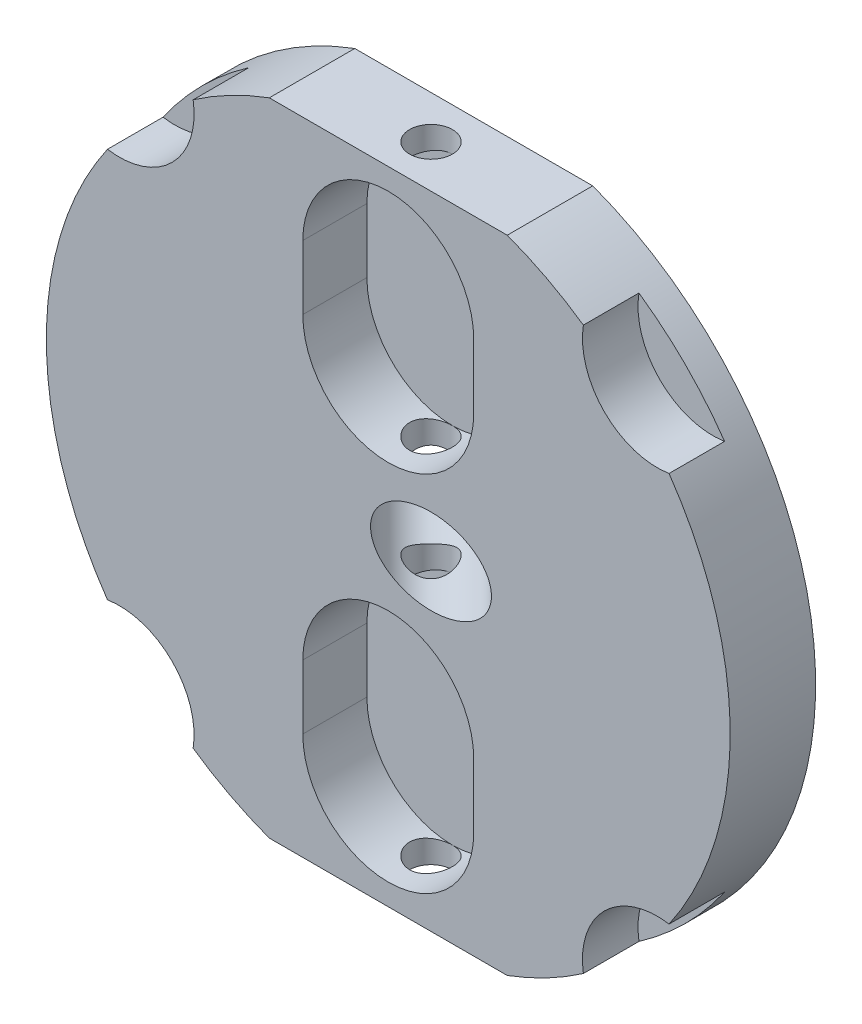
ISO-10303-21;
HEADER;
FILE_DESCRIPTION(('STEP AP214'),'2;1');
FILE_NAME('part.step','',(''),(''),'','','');
FILE_SCHEMA(('AUTOMOTIVE_DESIGN { 1 0 10303 214 1 1 1 1 }'));
ENDSEC;
DATA;
#1=APPLICATION_CONTEXT('core data for automotive mechanical design processes');
#2=APPLICATION_PROTOCOL_DEFINITION('international standard','automotive_design',2000,#1);
#3=PRODUCT_CONTEXT('',#1,'mechanical');
#4=PRODUCT('Part','Part','',(#3));
#5=PRODUCT_RELATED_PRODUCT_CATEGORY('part','',(#4));
#6=PRODUCT_DEFINITION_FORMATION('','',#4);
#7=PRODUCT_DEFINITION_CONTEXT('part definition',#1,'design');
#8=PRODUCT_DEFINITION('design','',#6,#7);
#9=PRODUCT_DEFINITION_SHAPE('','',#8);
#10=(LENGTH_UNIT() NAMED_UNIT(*) SI_UNIT(.MILLI.,.METRE.));
#11=(NAMED_UNIT(*) PLANE_ANGLE_UNIT() SI_UNIT($,.RADIAN.));
#12=(NAMED_UNIT(*) SI_UNIT($,.STERADIAN.) SOLID_ANGLE_UNIT());
#13=UNCERTAINTY_MEASURE_WITH_UNIT(LENGTH_MEASURE(1.E-05),#10,'distance_accuracy_value','');
#14=(GEOMETRIC_REPRESENTATION_CONTEXT(3) GLOBAL_UNCERTAINTY_ASSIGNED_CONTEXT((#13)) GLOBAL_UNIT_ASSIGNED_CONTEXT((#10,
#11,#12)) REPRESENTATION_CONTEXT('',''));
#15=CARTESIAN_POINT('',(0.,0.,0.));
#16=DIRECTION('',(0.,0.,1.));
#17=DIRECTION('',(1.,0.,0.));
#18=AXIS2_PLACEMENT_3D('',#15,#16,#17);
#19=CARTESIAN_POINT('',(0.,-7.99999999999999,0.));
#20=DIRECTION('',(0.,1.,0.));
#21=DIRECTION('',(0.,0.,1.));
#22=AXIS2_PLACEMENT_3D('',#19,#20,#21);
#23=CYLINDRICAL_SURFACE('',#22,0.5);
#24=CARTESIAN_POINT('',(0.,-7.49999999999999,0.));
#25=DIRECTION('',(0.,-1.,0.));
#26=DIRECTION('',(1.,0.,0.));
#27=AXIS2_PLACEMENT_3D('',#24,#25,#26);
#28=CIRCLE('',#27,0.5);
#29=CARTESIAN_POINT('',(0.5,-7.49999999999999,0.));
#30=VERTEX_POINT('',#29);
#31=EDGE_CURVE('E230',#30,#30,#28,.F.);
#32=ORIENTED_EDGE('',*,*,#31,.F.);
#33=EDGE_LOOP('',(#32));
#34=FACE_BOUND('',#33,.T.);
#35=CARTESIAN_POINT('',(0.,-6.99999999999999,0.5));
#36=CARTESIAN_POINT('',(-0.0276253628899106,-6.99999953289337,0.499999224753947));
#37=CARTESIAN_POINT('',(-0.0552593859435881,-6.9994219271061,0.497702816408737));
#38=CARTESIAN_POINT('',(-0.109735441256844,-6.99717371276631,0.488591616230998));
#39=CARTESIAN_POINT('',(-0.136577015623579,-6.99550248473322,0.481774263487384));
#40=CARTESIAN_POINT('',(-0.188673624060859,-6.99125208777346,0.463853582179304));
#41=CARTESIAN_POINT('',(-0.213930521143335,-6.98867400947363,0.452755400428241));
#42=CARTESIAN_POINT('',(-0.262224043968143,-6.98288447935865,0.426606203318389));
#43=CARTESIAN_POINT('',(-0.28526059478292,-6.97967300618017,0.411555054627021));
#44=CARTESIAN_POINT('',(-0.328933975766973,-6.97289137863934,0.377599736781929));
#45=CARTESIAN_POINT('',(-0.349518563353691,-6.96931569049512,0.358629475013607));
#46=CARTESIAN_POINT('',(-0.387249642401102,-6.96224540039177,0.317515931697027));
#47=CARTESIAN_POINT('',(-0.404395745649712,-6.95875080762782,0.295372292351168));
#48=CARTESIAN_POINT('',(-0.435008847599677,-6.95218258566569,0.248134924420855));
#49=CARTESIAN_POINT('',(-0.448417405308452,-6.94911598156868,0.223002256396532));
#50=CARTESIAN_POINT('',(-0.470798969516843,-6.94383164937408,0.170750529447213));
#51=CARTESIAN_POINT('',(-0.479772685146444,-6.94161378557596,0.143631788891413));
#52=CARTESIAN_POINT('',(-0.492851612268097,-6.93833492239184,0.0887521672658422));
#53=CARTESIAN_POINT('',(-0.497050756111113,-6.93725163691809,0.0610150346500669));
#54=CARTESIAN_POINT('',(-0.500753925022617,-6.93629787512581,0.00521047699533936));
#55=CARTESIAN_POINT('',(-0.500258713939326,-6.93642720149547,-0.0228568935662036));
#56=CARTESIAN_POINT('',(-0.49466217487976,-6.93786401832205,-0.0778052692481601));
#57=CARTESIAN_POINT('',(-0.489672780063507,-6.93914287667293,-0.104698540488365));
#58=CARTESIAN_POINT('',(-0.475408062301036,-6.94268903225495,-0.157253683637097));
#59=CARTESIAN_POINT('',(-0.466132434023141,-6.94495639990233,-0.182915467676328));
#60=CARTESIAN_POINT('',(-0.443463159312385,-6.95025037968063,-0.232579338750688));
#61=CARTESIAN_POINT('',(-0.430028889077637,-6.95328442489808,-0.256562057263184));
#62=CARTESIAN_POINT('',(-0.399452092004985,-6.95976570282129,-0.301972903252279));
#63=CARTESIAN_POINT('',(-0.382308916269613,-6.96321300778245,-0.323400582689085));
#64=CARTESIAN_POINT('',(-0.344221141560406,-6.9702529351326,-0.3637345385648));
#65=CARTESIAN_POINT('',(-0.323182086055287,-6.97384689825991,-0.382551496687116));
#66=CARTESIAN_POINT('',(-0.278203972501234,-6.98068655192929,-0.416407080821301));
#67=CARTESIAN_POINT('',(-0.254264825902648,-6.98393223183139,-0.431445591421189));
#68=CARTESIAN_POINT('',(-0.204038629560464,-6.98972577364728,-0.457350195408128));
#69=CARTESIAN_POINT('',(-0.177743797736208,-6.99227120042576,-0.468201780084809));
#70=CARTESIAN_POINT('',(-0.123625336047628,-6.99635972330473,-0.485305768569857));
#71=CARTESIAN_POINT('',(-0.0958019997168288,-6.99790301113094,-0.491559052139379));
#72=CARTESIAN_POINT('',(-0.0401799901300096,-6.99978499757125,-0.499152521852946));
#73=CARTESIAN_POINT('',(-0.0123989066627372,-7.00015351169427,-0.500614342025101));
#74=CARTESIAN_POINT('',(0.0430109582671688,-6.99972934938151,-0.498916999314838));
#75=CARTESIAN_POINT('',(0.0706397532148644,-6.99893677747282,-0.495758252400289));
#76=CARTESIAN_POINT('',(0.124538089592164,-6.99629860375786,-0.485009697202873));
#77=CARTESIAN_POINT('',(0.150821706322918,-6.99446878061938,-0.477486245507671));
#78=CARTESIAN_POINT('',(0.201752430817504,-6.98996235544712,-0.458297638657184));
#79=CARTESIAN_POINT('',(0.226399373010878,-6.98728566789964,-0.446632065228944));
#80=CARTESIAN_POINT('',(0.273841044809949,-6.98131102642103,-0.419254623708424));
#81=CARTESIAN_POINT('',(0.29659514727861,-6.97800289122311,-0.403474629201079));
#82=CARTESIAN_POINT('',(0.339175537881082,-6.97114836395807,-0.368403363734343));
#83=CARTESIAN_POINT('',(0.359001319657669,-6.96760193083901,-0.349111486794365));
#84=CARTESIAN_POINT('',(0.39566352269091,-6.96056318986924,-0.306999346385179));
#85=CARTESIAN_POINT('',(0.412414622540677,-6.95707434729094,-0.284104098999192));
#86=CARTESIAN_POINT('',(0.441836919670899,-6.95064292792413,-0.235755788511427));
#87=CARTESIAN_POINT('',(0.454508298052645,-6.94770032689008,-0.210302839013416));
#88=CARTESIAN_POINT('',(0.475317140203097,-6.94272698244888,-0.157698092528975));
#89=CARTESIAN_POINT('',(0.483481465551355,-6.94069085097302,-0.130557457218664));
#90=CARTESIAN_POINT('',(0.495115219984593,-6.93775581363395,-0.0752301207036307));
#91=CARTESIAN_POINT('',(0.498585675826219,-6.93685665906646,-0.0470436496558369));
#92=CARTESIAN_POINT('',(0.500679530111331,-6.93631633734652,0.00870700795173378));
#93=CARTESIAN_POINT('',(0.499439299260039,-6.93663977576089,0.0362658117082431));
#94=CARTESIAN_POINT('',(0.492459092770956,-6.93842636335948,0.0907679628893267));
#95=CARTESIAN_POINT('',(0.486719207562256,-6.93988948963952,0.117711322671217));
#96=CARTESIAN_POINT('',(0.470977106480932,-6.94377086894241,0.170069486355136));
#97=CARTESIAN_POINT('',(0.461000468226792,-6.94618338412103,0.195492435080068));
#98=CARTESIAN_POINT('',(0.437088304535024,-6.95169251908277,0.244321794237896));
#99=CARTESIAN_POINT('',(0.423152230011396,-6.95478923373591,0.267727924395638));
#100=CARTESIAN_POINT('',(0.391289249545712,-6.96141878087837,0.31251820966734));
#101=CARTESIAN_POINT('',(0.373267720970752,-6.96496088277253,0.333833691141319));
#102=CARTESIAN_POINT('',(0.333929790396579,-6.97202675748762,0.373182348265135));
#103=CARTESIAN_POINT('',(0.312612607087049,-6.97555052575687,0.391214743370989));
#104=CARTESIAN_POINT('',(0.266822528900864,-6.98225885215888,0.423803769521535));
#105=CARTESIAN_POINT('',(0.242299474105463,-6.98543611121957,0.438291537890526));
#106=CARTESIAN_POINT('',(0.191088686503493,-6.99101641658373,0.462915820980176));
#107=CARTESIAN_POINT('',(0.16440252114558,-6.9934200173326,0.473055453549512));
#108=CARTESIAN_POINT('',(0.114803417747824,-6.99682686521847,0.487190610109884));
#109=CARTESIAN_POINT('',(0.0921267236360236,-6.99800861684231,0.491983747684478));
#110=CARTESIAN_POINT('',(0.0463020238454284,-6.99959535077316,0.49838864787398));
#111=CARTESIAN_POINT('',(0.0231540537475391,-7.00000039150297,0.500000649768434));
#112=CARTESIAN_POINT('',(0.,-6.99999999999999,0.5));
#113=B_SPLINE_CURVE_WITH_KNOTS('',3,(#35,#36,#37,#38,#39,#40,#41,#42,#43,#44,#45,#46,#47,#48,
#49,#50,#51,#52,#53,#54,#55,#56,#57,#58,#59,#60,#61,#62,#63,#64,#65,#66,#67,#68,#69,#70,#71,#72,
#73,#74,#75,#76,#77,#78,#79,#80,#81,#82,#83,#84,#85,#86,#87,#88,#89,#90,#91,#92,#93,#94,#95,#96,
#97,#98,#99,#100,#101,#102,#103,#104,#105,#106,#107,#108,#109,#110,#111,#112),.UNSPECIFIED.,.T.,
.F.,(4,2,2,2,2,2,2,2,2,2,2,2,2,2,2,2,2,2,2,2,2,2,2,2,2,2,2,2,2,2,2,2,2,2,2,2,2,2,4),(0.,
0.0827912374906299,0.165629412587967,0.248368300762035,0.331109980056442,0.41538145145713,
0.49966243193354,0.585195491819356,0.670714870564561,0.754520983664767,0.838313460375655,
0.920074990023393,1.00184234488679,1.08443509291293,1.16704230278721,1.25200500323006,
1.33697029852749,1.42222743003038,1.50746824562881,1.59052769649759,1.67357967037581,
1.75540091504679,1.83723042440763,1.92051195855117,2.0038078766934,2.08914836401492,
2.17448506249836,2.25930751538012,2.34411141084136,2.42647926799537,2.50884546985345,
2.59072133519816,2.67260856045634,2.75663192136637,2.84067523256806,2.92624061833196,
3.01174454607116,3.08114080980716,3.1505318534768),.UNSPECIFIED.);
#114=CARTESIAN_POINT('',(0.,-6.99999999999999,-0.500000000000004));
#115=VERTEX_POINT('',#114);
#116=EDGE_CURVE('E418',#115,#115,#113,.T.);
#117=ORIENTED_EDGE('',*,*,#116,.F.);
#118=EDGE_LOOP('',(#117));
#119=FACE_BOUND('',#118,.T.);
#120=ADVANCED_FACE('F35',(#34,#119),#23,.F.);
#121=CARTESIAN_POINT('',(0.,-0.935414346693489,0.5));
#122=CARTESIAN_POINT('',(-0.0277499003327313,-0.927997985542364,0.500000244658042));
#123=CARTESIAN_POINT('',(-0.0554769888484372,-0.920496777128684,0.497690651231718));
#124=CARTESIAN_POINT('',(-0.110377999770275,-0.906096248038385,0.48845950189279));
#125=CARTESIAN_POINT('',(-0.137550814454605,-0.899198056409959,0.481529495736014));
#126=CARTESIAN_POINT('',(-0.190775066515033,-0.88682406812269,0.463035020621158));
#127=CARTESIAN_POINT('',(-0.216821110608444,-0.881354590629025,0.451450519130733));
#128=CARTESIAN_POINT('',(-0.266819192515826,-0.872693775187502,0.423816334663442));
#129=CARTESIAN_POINT('',(-0.290774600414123,-0.869498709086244,0.407774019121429));
#130=CARTESIAN_POINT('',(-0.333660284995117,-0.866088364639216,0.373307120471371));
#131=CARTESIAN_POINT('',(-0.352848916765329,-0.865630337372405,0.355227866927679));
#132=CARTESIAN_POINT('',(-0.388102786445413,-0.867115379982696,0.316330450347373));
#133=CARTESIAN_POINT('',(-0.404167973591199,-0.869058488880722,0.295512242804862));
#134=CARTESIAN_POINT('',(-0.431785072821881,-0.874852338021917,0.253291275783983));
#135=CARTESIAN_POINT('',(-0.443564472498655,-0.878569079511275,0.232017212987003));
#136=CARTESIAN_POINT('',(-0.463841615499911,-0.887403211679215,0.18823769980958));
#137=CARTESIAN_POINT('',(-0.472338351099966,-0.892521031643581,0.165731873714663));
#138=CARTESIAN_POINT('',(-0.486623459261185,-0.904167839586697,0.11781216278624));
#139=CARTESIAN_POINT('',(-0.492085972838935,-0.910783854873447,0.0923226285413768));
#140=CARTESIAN_POINT('',(-0.498999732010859,-0.924416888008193,0.0409032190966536));
#141=CARTESIAN_POINT('',(-0.500448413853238,-0.931434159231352,0.0149730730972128));
#142=CARTESIAN_POINT('',(-0.499249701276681,-0.945990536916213,-0.0397033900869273));
#143=CARTESIAN_POINT('',(-0.496138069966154,-0.953503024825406,-0.0684482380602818));
#144=CARTESIAN_POINT('',(-0.484926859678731,-0.967437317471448,-0.125230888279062));
#145=CARTESIAN_POINT('',(-0.476827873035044,-0.973859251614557,-0.153268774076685));
#146=CARTESIAN_POINT('',(-0.455941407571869,-0.984772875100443,-0.207205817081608));
#147=CARTESIAN_POINT('',(-0.44326372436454,-0.989304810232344,-0.233138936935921));
#148=CARTESIAN_POINT('',(-0.413462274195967,-0.996110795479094,-0.282632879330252));
#149=CARTESIAN_POINT('',(-0.396342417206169,-0.99838682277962,-0.306195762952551));
#150=CARTESIAN_POINT('',(-0.360125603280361,-1.0003032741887,-0.347841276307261));
#151=CARTESIAN_POINT('',(-0.341399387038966,-1.00018523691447,-0.366236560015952));
#152=CARTESIAN_POINT('',(-0.301375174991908,-0.997914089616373,-0.399818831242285));
#153=CARTESIAN_POINT('',(-0.28007745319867,-0.995761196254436,-0.41500616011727));
#154=CARTESIAN_POINT('',(-0.236289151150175,-0.989736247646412,-0.441361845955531));
#155=CARTESIAN_POINT('',(-0.213857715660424,-0.985920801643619,-0.452642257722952));
#156=CARTESIAN_POINT('',(-0.167804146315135,-0.976926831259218,-0.471659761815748));
#157=CARTESIAN_POINT('',(-0.144181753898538,-0.971748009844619,-0.479396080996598));
#158=CARTESIAN_POINT('',(-0.0945421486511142,-0.960044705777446,-0.491693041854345));
#159=CARTESIAN_POINT('',(-0.0684750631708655,-0.953450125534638,-0.495984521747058));
#160=CARTESIAN_POINT('',(-0.0161089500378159,-0.939769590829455,-0.500431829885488));
#161=CARTESIAN_POINT('',(0.0101902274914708,-0.932683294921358,-0.500584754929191));
#162=CARTESIAN_POINT('',(0.0649706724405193,-0.918006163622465,-0.49658962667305));
#163=CARTESIAN_POINT('',(0.0934276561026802,-0.910429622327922,-0.492040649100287));
#164=CARTESIAN_POINT('',(0.149394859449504,-0.896347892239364,-0.478030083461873));
#165=CARTESIAN_POINT('',(0.176905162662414,-0.889842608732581,-0.46856893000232));
#166=CARTESIAN_POINT('',(0.229702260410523,-0.878920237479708,-0.445034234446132));
#167=CARTESIAN_POINT('',(0.255021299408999,-0.874465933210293,-0.431051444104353));
#168=CARTESIAN_POINT('',(0.303061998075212,-0.868207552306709,-0.398733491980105));
#169=CARTESIAN_POINT('',(0.32578723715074,-0.866399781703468,-0.380404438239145));
#170=CARTESIAN_POINT('',(0.36506278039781,-0.86579660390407,-0.342602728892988));
#171=CARTESIAN_POINT('',(0.382030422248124,-0.866649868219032,-0.323566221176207));
#172=CARTESIAN_POINT('',(0.412792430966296,-0.870493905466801,-0.283275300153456));
#173=CARTESIAN_POINT('',(0.426586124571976,-0.873485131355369,-0.262020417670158));
#174=CARTESIAN_POINT('',(0.450424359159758,-0.881114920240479,-0.218451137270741));
#175=CARTESIAN_POINT('',(0.460548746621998,-0.885713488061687,-0.196172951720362));
#176=CARTESIAN_POINT('',(0.47739150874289,-0.896062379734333,-0.150623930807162));
#177=CARTESIAN_POINT('',(0.484108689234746,-0.901813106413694,-0.127352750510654));
#178=CARTESIAN_POINT('',(0.494693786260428,-0.914643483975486,-0.0774732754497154));
#179=CARTESIAN_POINT('',(0.498134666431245,-0.921799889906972,-0.0507939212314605));
#180=CARTESIAN_POINT('',(0.50071152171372,-0.9361644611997,0.00277004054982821));
#181=CARTESIAN_POINT('',(0.499844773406,-0.943372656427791,0.0296547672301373));
#182=CARTESIAN_POINT('',(0.493529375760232,-0.95772830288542,0.085290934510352));
#183=CARTESIAN_POINT('',(0.487712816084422,-0.964822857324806,0.114015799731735));
#184=CARTESIAN_POINT('',(0.471014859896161,-0.977493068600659,0.170310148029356));
#185=CARTESIAN_POINT('',(0.460136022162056,-0.983069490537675,0.197880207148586));
#186=CARTESIAN_POINT('',(0.434250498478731,-0.991787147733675,0.249418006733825));
#187=CARTESIAN_POINT('',(0.419516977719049,-0.995049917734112,0.273501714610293));
#188=CARTESIAN_POINT('',(0.386083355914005,-0.999263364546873,0.318957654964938));
#189=CARTESIAN_POINT('',(0.367386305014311,-1.00021581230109,0.34033195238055));
#190=CARTESIAN_POINT('',(0.328586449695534,-0.999724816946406,0.377741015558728));
#191=CARTESIAN_POINT('',(0.308780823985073,-0.998498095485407,0.394088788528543));
#192=CARTESIAN_POINT('',(0.267036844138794,-0.994182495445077,0.423489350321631));
#193=CARTESIAN_POINT('',(0.245097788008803,-0.99109300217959,0.436541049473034));
#194=CARTESIAN_POINT('',(0.199735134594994,-0.983343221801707,0.459072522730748));
#195=CARTESIAN_POINT('',(0.176311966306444,-0.978683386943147,0.468553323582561));
#196=CARTESIAN_POINT('',(0.128580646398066,-0.96820533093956,0.483833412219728));
#197=CARTESIAN_POINT('',(0.104273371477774,-0.962388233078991,0.489636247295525));
#198=CARTESIAN_POINT('',(0.0533263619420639,-0.949582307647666,0.497868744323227));
#199=CARTESIAN_POINT('',(0.0266526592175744,-0.94253746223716,0.499999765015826));
#200=CARTESIAN_POINT('',(0.,-0.935414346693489,0.5));
#201=B_SPLINE_CURVE_WITH_KNOTS('',3,(#121,#122,#123,#124,#125,#126,#127,#128,#129,#130,#131,
#132,#133,#134,#135,#136,#137,#138,#139,#140,#141,#142,#143,#144,#145,#146,#147,#148,#149,#150,
#151,#152,#153,#154,#155,#156,#157,#158,#159,#160,#161,#162,#163,#164,#165,#166,#167,#168,#169,
#170,#171,#172,#173,#174,#175,#176,#177,#178,#179,#180,#181,#182,#183,#184,#185,#186,#187,#188,
#189,#190,#191,#192,#193,#194,#195,#196,#197,#198,#199,#200),.UNSPECIFIED.,.T.,.F.,(4,2,2,2,2,2,
2,2,2,2,2,2,2,2,2,2,2,2,2,2,2,2,2,2,2,2,2,2,2,2,2,2,2,2,2,2,2,2,2,4),(0.,0.0860790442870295,
0.17231595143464,0.258928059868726,0.345397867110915,0.424069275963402,0.502741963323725,
0.576235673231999,0.6497519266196,0.73011363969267,0.81052667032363,0.899714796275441,
0.988892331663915,1.07605976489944,1.16315073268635,1.24150309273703,1.31984711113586,
1.3957098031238,1.47158903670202,1.55293878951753,1.63434560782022,1.72331593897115,
1.81227839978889,1.89955592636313,1.98671151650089,2.06286944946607,2.13904352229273,
2.21344323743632,2.28786901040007,2.37103155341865,2.45424668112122,2.54424838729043,
2.63420465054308,2.71899100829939,2.80371235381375,2.88047280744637,2.95725860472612,
3.03402230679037,3.11071185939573,3.19338730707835),.UNSPECIFIED.);
#202=CARTESIAN_POINT('',(0.,-0.935414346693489,0.5));
#203=VERTEX_POINT('',#202);
#204=EDGE_CURVE('E234',#203,#203,#201,.T.);
#205=ORIENTED_EDGE('',*,*,#204,.F.);
#206=EDGE_LOOP('',(#205));
#207=FACE_BOUND('',#206,.T.);
#208=CARTESIAN_POINT('',(0.,-1.5,0.5));
#209=CARTESIAN_POINT('',(0.0276253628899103,-1.50000046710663,0.499999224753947));
#210=CARTESIAN_POINT('',(0.0552593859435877,-1.50057807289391,0.497702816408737));
#211=CARTESIAN_POINT('',(0.109735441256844,-1.5028262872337,0.488591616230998));
#212=CARTESIAN_POINT('',(0.13657701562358,-1.50449751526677,0.481774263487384));
#213=CARTESIAN_POINT('',(0.188673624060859,-1.50874791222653,0.463853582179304));
#214=CARTESIAN_POINT('',(0.213930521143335,-1.51132599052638,0.452755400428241));
#215=CARTESIAN_POINT('',(0.262224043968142,-1.51711552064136,0.426606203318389));
#216=CARTESIAN_POINT('',(0.28526059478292,-1.52032699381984,0.411555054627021));
#217=CARTESIAN_POINT('',(0.328933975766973,-1.52710862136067,0.37759973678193));
#218=CARTESIAN_POINT('',(0.349518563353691,-1.53068430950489,0.358629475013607));
#219=CARTESIAN_POINT('',(0.387249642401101,-1.53775459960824,0.317515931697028));
#220=CARTESIAN_POINT('',(0.404395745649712,-1.54124919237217,0.295372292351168));
#221=CARTESIAN_POINT('',(0.435008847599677,-1.5478174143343,0.248134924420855));
#222=CARTESIAN_POINT('',(0.448417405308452,-1.55088401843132,0.223002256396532));
#223=CARTESIAN_POINT('',(0.470798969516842,-1.55616835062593,0.170750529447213));
#224=CARTESIAN_POINT('',(0.479772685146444,-1.55838621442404,0.143631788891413));
#225=CARTESIAN_POINT('',(0.492851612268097,-1.56166507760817,0.0887521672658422));
#226=CARTESIAN_POINT('',(0.497050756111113,-1.56274836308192,0.0610150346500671));
#227=CARTESIAN_POINT('',(0.500753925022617,-1.5637021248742,0.00521047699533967));
#228=CARTESIAN_POINT('',(0.500258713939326,-1.56357279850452,-0.0228568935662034));
#229=CARTESIAN_POINT('',(0.49466217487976,-1.56213598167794,-0.0778052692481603));
#230=CARTESIAN_POINT('',(0.489672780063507,-1.56085712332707,-0.104698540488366));
#231=CARTESIAN_POINT('',(0.475408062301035,-1.55731096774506,-0.157253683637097));
#232=CARTESIAN_POINT('',(0.466132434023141,-1.55504360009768,-0.182915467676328));
#233=CARTESIAN_POINT('',(0.443463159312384,-1.54974962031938,-0.232579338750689));
#234=CARTESIAN_POINT('',(0.430028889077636,-1.54671557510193,-0.256562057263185));
#235=CARTESIAN_POINT('',(0.399452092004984,-1.54023429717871,-0.30197290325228));
#236=CARTESIAN_POINT('',(0.382308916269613,-1.53678699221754,-0.323400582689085));
#237=CARTESIAN_POINT('',(0.344221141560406,-1.52974706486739,-0.3637345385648));
#238=CARTESIAN_POINT('',(0.323182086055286,-1.5261531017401,-0.382551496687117));
#239=CARTESIAN_POINT('',(0.278203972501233,-1.51931344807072,-0.416407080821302));
#240=CARTESIAN_POINT('',(0.254264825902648,-1.51606776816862,-0.431445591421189));
#241=CARTESIAN_POINT('',(0.204038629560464,-1.51027422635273,-0.457350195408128));
#242=CARTESIAN_POINT('',(0.177743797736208,-1.50772879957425,-0.468201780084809));
#243=CARTESIAN_POINT('',(0.123625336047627,-1.50364027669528,-0.485305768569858));
#244=CARTESIAN_POINT('',(0.0958019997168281,-1.50209698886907,-0.491559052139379));
#245=CARTESIAN_POINT('',(0.0401799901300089,-1.50021500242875,-0.499152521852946));
#246=CARTESIAN_POINT('',(0.0123989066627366,-1.49984648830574,-0.500614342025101));
#247=CARTESIAN_POINT('',(-0.0430109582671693,-1.5002706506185,-0.498916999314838));
#248=CARTESIAN_POINT('',(-0.070639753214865,-1.50106322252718,-0.495758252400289));
#249=CARTESIAN_POINT('',(-0.124538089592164,-1.50370139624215,-0.485009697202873));
#250=CARTESIAN_POINT('',(-0.150821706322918,-1.50553121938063,-0.477486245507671));
#251=CARTESIAN_POINT('',(-0.201752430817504,-1.51003764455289,-0.458297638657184));
#252=CARTESIAN_POINT('',(-0.226399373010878,-1.51271433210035,-0.446632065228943));
#253=CARTESIAN_POINT('',(-0.273841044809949,-1.51868897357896,-0.419254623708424));
#254=CARTESIAN_POINT('',(-0.296595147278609,-1.5219971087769,-0.40347462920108));
#255=CARTESIAN_POINT('',(-0.339175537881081,-1.52885163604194,-0.368403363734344));
#256=CARTESIAN_POINT('',(-0.359001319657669,-1.53239806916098,-0.349111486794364));
#257=CARTESIAN_POINT('',(-0.39566352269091,-1.53943681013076,-0.306999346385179));
#258=CARTESIAN_POINT('',(-0.412414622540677,-1.54292565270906,-0.284104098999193));
#259=CARTESIAN_POINT('',(-0.441836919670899,-1.54935707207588,-0.235755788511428));
#260=CARTESIAN_POINT('',(-0.454508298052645,-1.55229967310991,-0.210302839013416));
#261=CARTESIAN_POINT('',(-0.475317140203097,-1.55727301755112,-0.157698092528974));
#262=CARTESIAN_POINT('',(-0.483481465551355,-1.55930914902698,-0.130557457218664));
#263=CARTESIAN_POINT('',(-0.495115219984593,-1.56224418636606,-0.0752301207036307));
#264=CARTESIAN_POINT('',(-0.498585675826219,-1.56314334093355,-0.0470436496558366));
#265=CARTESIAN_POINT('',(-0.500679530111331,-1.56368366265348,0.00870700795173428));
#266=CARTESIAN_POINT('',(-0.499439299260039,-1.56336022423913,0.0362658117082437));
#267=CARTESIAN_POINT('',(-0.492459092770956,-1.56157363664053,0.0907679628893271));
#268=CARTESIAN_POINT('',(-0.486719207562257,-1.56011051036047,0.117711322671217));
#269=CARTESIAN_POINT('',(-0.470977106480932,-1.55622913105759,0.170069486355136));
#270=CARTESIAN_POINT('',(-0.461000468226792,-1.55381661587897,0.195492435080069));
#271=CARTESIAN_POINT('',(-0.437088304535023,-1.54830748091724,0.244321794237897));
#272=CARTESIAN_POINT('',(-0.423152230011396,-1.5452107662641,0.267727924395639));
#273=CARTESIAN_POINT('',(-0.391289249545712,-1.53858121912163,0.31251820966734));
#274=CARTESIAN_POINT('',(-0.373267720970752,-1.53503911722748,0.333833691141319));
#275=CARTESIAN_POINT('',(-0.333929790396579,-1.52797324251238,0.373182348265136));
#276=CARTESIAN_POINT('',(-0.312612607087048,-1.52444947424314,0.39121474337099));
#277=CARTESIAN_POINT('',(-0.266822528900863,-1.51774114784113,0.423803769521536));
#278=CARTESIAN_POINT('',(-0.242299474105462,-1.51456388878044,0.438291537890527));
#279=CARTESIAN_POINT('',(-0.191088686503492,-1.50898358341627,0.462915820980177));
#280=CARTESIAN_POINT('',(-0.16440252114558,-1.50657998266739,0.473055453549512));
#281=CARTESIAN_POINT('',(-0.114803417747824,-1.50317313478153,0.487190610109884));
#282=CARTESIAN_POINT('',(-0.0921267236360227,-1.5019913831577,0.491983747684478));
#283=CARTESIAN_POINT('',(-0.0463020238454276,-1.50040464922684,0.498388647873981));
#284=CARTESIAN_POINT('',(-0.0231540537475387,-1.49999960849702,0.500000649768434));
#285=CARTESIAN_POINT('',(0.,-1.5,0.5));
#286=B_SPLINE_CURVE_WITH_KNOTS('',3,(#208,#209,#210,#211,#212,#213,#214,#215,#216,#217,#218,
#219,#220,#221,#222,#223,#224,#225,#226,#227,#228,#229,#230,#231,#232,#233,#234,#235,#236,#237,
#238,#239,#240,#241,#242,#243,#244,#245,#246,#247,#248,#249,#250,#251,#252,#253,#254,#255,#256,
#257,#258,#259,#260,#261,#262,#263,#264,#265,#266,#267,#268,#269,#270,#271,#272,#273,#274,#275,
#276,#277,#278,#279,#280,#281,#282,#283,#284,#285),.UNSPECIFIED.,.T.,.F.,(4,2,2,2,2,2,2,2,2,2,2,
2,2,2,2,2,2,2,2,2,2,2,2,2,2,2,2,2,2,2,2,2,2,2,2,2,2,2,4),(0.,0.0827912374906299,
0.165629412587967,0.248368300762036,0.331109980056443,0.41538145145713,0.499662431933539,
0.585195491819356,0.670714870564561,0.754520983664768,0.838313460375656,0.920074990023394,
1.00184234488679,1.08443509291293,1.16704230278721,1.25200500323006,1.33697029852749,
1.42222743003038,1.50746824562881,1.59052769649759,1.67357967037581,1.75540091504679,
1.83723042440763,1.92051195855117,2.0038078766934,2.08914836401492,2.17448506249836,
2.25930751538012,2.34411141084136,2.42647926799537,2.50884546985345,2.59072133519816,
2.67260856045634,2.75663192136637,2.84067523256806,2.92624061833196,3.01174454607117,
3.08114080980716,3.1505318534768),.UNSPECIFIED.);
#287=CARTESIAN_POINT('',(0.,-1.5,-0.500000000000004));
#288=VERTEX_POINT('',#287);
#289=EDGE_CURVE('E421',#288,#288,#286,.T.);
#290=ORIENTED_EDGE('',*,*,#289,.F.);
#291=EDGE_LOOP('',(#290));
#292=FACE_BOUND('',#291,.T.);
#293=ADVANCED_FACE('F328',(#207,#292),#23,.F.);
#294=CARTESIAN_POINT('',(0.,7.99999999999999,0.999999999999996));
#295=DIRECTION('',(0.,0.,-1.));
#296=DIRECTION('',(-1.,0.,0.));
#297=AXIS2_PLACEMENT_3D('',#294,#295,#296);
#298=PLANE('',#297);
#299=CARTESIAN_POINT('',(0.999999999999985,0.,0.999999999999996));
#300=DIRECTION('',(0.,0.,-1.));
#301=DIRECTION('',(-1.,0.,0.));
#302=AXIS2_PLACEMENT_3D('',#299,#300,#301);
#303=ELLIPSE('',#302,1.41421356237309,1.);
#304=CARTESIAN_POINT('',(-0.414213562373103,0.,0.999999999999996));
#305=VERTEX_POINT('',#304);
#306=EDGE_CURVE('E240',#305,#305,#303,.F.);
#307=ORIENTED_EDGE('',*,*,#306,.F.);
#308=EDGE_LOOP('',(#307));
#309=FACE_BOUND('',#308,.T.);
#310=CARTESIAN_POINT('',(0.,0.,0.999999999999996));
#311=DIRECTION('',(0.,0.,1.));
#312=DIRECTION('',(1.,0.,0.));
#313=AXIS2_PLACEMENT_3D('',#310,#311,#312);
#314=CIRCLE('',#313,8.);
#315=CARTESIAN_POINT('',(6.56954746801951,-4.56519945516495,0.999999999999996));
#316=VERTEX_POINT('',#315);
#317=CARTESIAN_POINT('',(6.56954746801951,4.56519945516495,0.999999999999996));
#318=VERTEX_POINT('',#317);
#319=EDGE_CURVE('E195',#316,#318,#314,.T.);
#320=ORIENTED_EDGE('',*,*,#319,.T.);
#321=CARTESIAN_POINT('',(6.29325035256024,6.2932503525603,0.999999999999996));
#322=DIRECTION('',(0.,0.,1.));
#323=DIRECTION('',(0.,-1.,0.));
#324=AXIS2_PLACEMENT_3D('',#321,#322,#323);
#325=CIRCLE('',#324,1.75);
#326=CARTESIAN_POINT('',(4.56519945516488,6.56954746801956,0.999999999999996));
#327=VERTEX_POINT('',#326);
#328=EDGE_CURVE('E183',#327,#318,#325,.T.);
#329=ORIENTED_EDGE('',*,*,#328,.F.);
#330=CARTESIAN_POINT('',(2.78388218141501,7.49999999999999,0.999999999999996));
#331=VERTEX_POINT('',#330);
#332=EDGE_CURVE('E203',#327,#331,#314,.T.);
#333=ORIENTED_EDGE('',*,*,#332,.T.);
#334=DIRECTION('',(1.,0.,0.));
#335=VECTOR('',#334,1.);
#336=CARTESIAN_POINT('',(0.,7.49999999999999,0.999999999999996));
#337=LINE('',#336,#335);
#338=CARTESIAN_POINT('',(-2.78388218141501,7.49999999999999,0.999999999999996));
#339=VERTEX_POINT('',#338);
#340=EDGE_CURVE('E238',#339,#331,#337,.T.);
#341=ORIENTED_EDGE('',*,*,#340,.F.);
#342=CARTESIAN_POINT('',(-4.56519945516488,6.56954746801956,0.999999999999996));
#343=VERTEX_POINT('',#342);
#344=EDGE_CURVE('E206',#339,#343,#314,.T.);
#345=ORIENTED_EDGE('',*,*,#344,.T.);
#346=CARTESIAN_POINT('',(-6.29325035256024,6.2932503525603,0.999999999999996));
#347=DIRECTION('',(0.,0.,1.));
#348=DIRECTION('',(1.,0.,0.));
#349=AXIS2_PLACEMENT_3D('',#346,#347,#348);
#350=CIRCLE('',#349,1.75);
#351=CARTESIAN_POINT('',(-6.56954746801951,4.56519945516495,0.999999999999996));
#352=VERTEX_POINT('',#351);
#353=EDGE_CURVE('E575',#352,#343,#350,.T.);
#354=ORIENTED_EDGE('',*,*,#353,.F.);
#355=CARTESIAN_POINT('',(-6.56954746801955,-4.56519945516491,0.999999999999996));
#356=VERTEX_POINT('',#355);
#357=EDGE_CURVE('E210',#352,#356,#314,.T.);
#358=ORIENTED_EDGE('',*,*,#357,.T.);
#359=CARTESIAN_POINT('',(-6.29325035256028,-6.29325035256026,0.999999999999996));
#360=DIRECTION('',(0.,0.,1.));
#361=DIRECTION('',(0.,1.,0.));
#362=AXIS2_PLACEMENT_3D('',#359,#360,#361);
#363=CIRCLE('',#362,1.75);
#364=CARTESIAN_POINT('',(-4.56519945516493,-6.56954746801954,0.999999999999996));
#365=VERTEX_POINT('',#364);
#366=EDGE_CURVE('E569',#365,#356,#363,.T.);
#367=ORIENTED_EDGE('',*,*,#366,.F.);
#368=CARTESIAN_POINT('',(-2.78388218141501,-7.49999999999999,0.999999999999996));
#369=VERTEX_POINT('',#368);
#370=EDGE_CURVE('E205',#365,#369,#314,.T.);
#371=ORIENTED_EDGE('',*,*,#370,.T.);
#372=DIRECTION('',(-1.,0.,0.));
#373=VECTOR('',#372,1.);
#374=CARTESIAN_POINT('',(0.,-7.49999999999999,0.999999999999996));
#375=LINE('',#374,#373);
#376=CARTESIAN_POINT('',(2.78388218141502,-7.49999999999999,0.999999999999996));
#377=VERTEX_POINT('',#376);
#378=EDGE_CURVE('E233',#377,#369,#375,.T.);
#379=ORIENTED_EDGE('',*,*,#378,.F.);
#380=CARTESIAN_POINT('',(4.56519945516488,-6.56954746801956,0.999999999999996));
#381=VERTEX_POINT('',#380);
#382=EDGE_CURVE('E202',#377,#381,#314,.T.);
#383=ORIENTED_EDGE('',*,*,#382,.T.);
#384=CARTESIAN_POINT('',(6.29325035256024,-6.2932503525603,0.999999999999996));
#385=DIRECTION('',(0.,0.,1.));
#386=DIRECTION('',(-1.,0.,0.));
#387=AXIS2_PLACEMENT_3D('',#384,#385,#386);
#388=CIRCLE('',#387,1.75);
#389=EDGE_CURVE('E201',#316,#381,#388,.T.);
#390=ORIENTED_EDGE('',*,*,#389,.F.);
#391=EDGE_LOOP('',(#320,#329,#333,#341,#345,#354,#358,#367,#371,#379,#383,#390));
#392=FACE_BOUND('',#391,.T.);
#393=DIRECTION('',(0.,-1.,0.));
#394=VECTOR('',#393,1.);
#395=CARTESIAN_POINT('',(-2.,5.,0.999999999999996));
#396=LINE('',#395,#394);
#397=CARTESIAN_POINT('',(-2.,4.99999999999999,0.999999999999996));
#398=VERTEX_POINT('',#397);
#399=CARTESIAN_POINT('',(-2.,3.5,0.999999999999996));
#400=VERTEX_POINT('',#399);
#401=EDGE_CURVE('E386',#398,#400,#396,.T.);
#402=ORIENTED_EDGE('',*,*,#401,.F.);
#403=CARTESIAN_POINT('',(0.,5.,0.999999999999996));
#404=DIRECTION('',(0.,0.,1.));
#405=DIRECTION('',(1.,0.,0.));
#406=AXIS2_PLACEMENT_3D('',#403,#404,#405);
#407=CIRCLE('',#406,2.);
#408=CARTESIAN_POINT('',(2.,5.,0.999999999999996));
#409=VERTEX_POINT('',#408);
#410=EDGE_CURVE('E394',#409,#398,#407,.T.);
#411=ORIENTED_EDGE('',*,*,#410,.F.);
#412=DIRECTION('',(0.,1.,0.));
#413=VECTOR('',#412,1.);
#414=CARTESIAN_POINT('',(2.,5.,0.999999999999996));
#415=LINE('',#414,#413);
#416=CARTESIAN_POINT('',(2.,3.5,0.999999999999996));
#417=VERTEX_POINT('',#416);
#418=EDGE_CURVE('E400',#417,#409,#415,.T.);
#419=ORIENTED_EDGE('',*,*,#418,.F.);
#420=CARTESIAN_POINT('',(0.,3.5,0.999999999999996));
#421=DIRECTION('',(0.,0.,1.));
#422=DIRECTION('',(1.,0.,0.));
#423=AXIS2_PLACEMENT_3D('',#420,#421,#422);
#424=CIRCLE('',#423,2.);
#425=EDGE_CURVE('E393',#400,#417,#424,.T.);
#426=ORIENTED_EDGE('',*,*,#425,.F.);
#427=EDGE_LOOP('',(#402,#411,#419,#426));
#428=FACE_BOUND('',#427,.T.);
#429=CARTESIAN_POINT('',(0.,-5.,0.999999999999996));
#430=DIRECTION('',(0.,0.,-1.));
#431=DIRECTION('',(1.,0.,0.));
#432=AXIS2_PLACEMENT_3D('',#429,#430,#431);
#433=CIRCLE('',#432,2.);
#434=CARTESIAN_POINT('',(2.,-5.,0.999999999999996));
#435=VERTEX_POINT('',#434);
#436=CARTESIAN_POINT('',(-2.,-5.,0.999999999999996));
#437=VERTEX_POINT('',#436);
#438=EDGE_CURVE('E579',#435,#437,#433,.T.);
#439=ORIENTED_EDGE('',*,*,#438,.T.);
#440=DIRECTION('',(0.,1.,0.));
#441=VECTOR('',#440,1.);
#442=CARTESIAN_POINT('',(-2.,-5.,0.999999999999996));
#443=LINE('',#442,#441);
#444=CARTESIAN_POINT('',(-2.,-3.5,0.999999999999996));
#445=VERTEX_POINT('',#444);
#446=EDGE_CURVE('E600',#437,#445,#443,.T.);
#447=ORIENTED_EDGE('',*,*,#446,.T.);
#448=CARTESIAN_POINT('',(0.,-3.5,0.999999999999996));
#449=DIRECTION('',(0.,0.,-1.));
#450=DIRECTION('',(1.,0.,0.));
#451=AXIS2_PLACEMENT_3D('',#448,#449,#450);
#452=CIRCLE('',#451,2.);
#453=CARTESIAN_POINT('',(2.,-3.5,0.999999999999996));
#454=VERTEX_POINT('',#453);
#455=EDGE_CURVE('E597',#445,#454,#452,.T.);
#456=ORIENTED_EDGE('',*,*,#455,.T.);
#457=DIRECTION('',(0.,-1.,0.));
#458=VECTOR('',#457,1.);
#459=CARTESIAN_POINT('',(2.,-5.,0.999999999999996));
#460=LINE('',#459,#458);
#461=EDGE_CURVE('E594',#454,#435,#460,.T.);
#462=ORIENTED_EDGE('',*,*,#461,.T.);
#463=EDGE_LOOP('',(#439,#447,#456,#462));
#464=FACE_BOUND('',#463,.T.);
#465=ADVANCED_FACE('F198',(#309,#392,#428,#464),#298,.F.);
#466=CARTESIAN_POINT('',(0.,6.99999999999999,0.5));
#467=CARTESIAN_POINT('',(-0.0276253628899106,6.99999953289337,0.499999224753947));
#468=CARTESIAN_POINT('',(-0.0552593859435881,6.9994219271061,0.497702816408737));
#469=CARTESIAN_POINT('',(-0.109735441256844,6.99717371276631,0.488591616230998));
#470=CARTESIAN_POINT('',(-0.136577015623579,6.99550248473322,0.481774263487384));
#471=CARTESIAN_POINT('',(-0.188673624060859,6.99125208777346,0.463853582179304));
#472=CARTESIAN_POINT('',(-0.213930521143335,6.98867400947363,0.452755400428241));
#473=CARTESIAN_POINT('',(-0.262224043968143,6.98288447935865,0.426606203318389));
#474=CARTESIAN_POINT('',(-0.28526059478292,6.97967300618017,0.411555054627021));
#475=CARTESIAN_POINT('',(-0.328933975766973,6.97289137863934,0.377599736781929));
#476=CARTESIAN_POINT('',(-0.349518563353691,6.96931569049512,0.358629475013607));
#477=CARTESIAN_POINT('',(-0.387249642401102,6.96224540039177,0.317515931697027));
#478=CARTESIAN_POINT('',(-0.404395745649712,6.95875080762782,0.295372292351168));
#479=CARTESIAN_POINT('',(-0.435008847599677,6.95218258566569,0.248134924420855));
#480=CARTESIAN_POINT('',(-0.448417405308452,6.94911598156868,0.223002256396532));
#481=CARTESIAN_POINT('',(-0.470798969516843,6.94383164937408,0.170750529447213));
#482=CARTESIAN_POINT('',(-0.479772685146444,6.94161378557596,0.143631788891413));
#483=CARTESIAN_POINT('',(-0.492851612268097,6.93833492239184,0.0887521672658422));
#484=CARTESIAN_POINT('',(-0.497050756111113,6.93725163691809,0.0610150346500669));
#485=CARTESIAN_POINT('',(-0.500753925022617,6.93629787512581,0.00521047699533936));
#486=CARTESIAN_POINT('',(-0.500258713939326,6.93642720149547,-0.0228568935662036));
#487=CARTESIAN_POINT('',(-0.49466217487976,6.93786401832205,-0.0778052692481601));
#488=CARTESIAN_POINT('',(-0.489672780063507,6.93914287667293,-0.104698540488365));
#489=CARTESIAN_POINT('',(-0.475408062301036,6.94268903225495,-0.157253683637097));
#490=CARTESIAN_POINT('',(-0.466132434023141,6.94495639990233,-0.182915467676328));
#491=CARTESIAN_POINT('',(-0.443463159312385,6.95025037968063,-0.232579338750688));
#492=CARTESIAN_POINT('',(-0.430028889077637,6.95328442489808,-0.256562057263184));
#493=CARTESIAN_POINT('',(-0.399452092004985,6.95976570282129,-0.301972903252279));
#494=CARTESIAN_POINT('',(-0.382308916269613,6.96321300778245,-0.323400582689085));
#495=CARTESIAN_POINT('',(-0.344221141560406,6.9702529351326,-0.3637345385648));
#496=CARTESIAN_POINT('',(-0.323182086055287,6.97384689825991,-0.382551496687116));
#497=CARTESIAN_POINT('',(-0.278203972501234,6.98068655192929,-0.416407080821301));
#498=CARTESIAN_POINT('',(-0.254264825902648,6.98393223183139,-0.431445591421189));
#499=CARTESIAN_POINT('',(-0.204038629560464,6.98972577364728,-0.457350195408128));
#500=CARTESIAN_POINT('',(-0.177743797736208,6.99227120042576,-0.468201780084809));
#501=CARTESIAN_POINT('',(-0.123625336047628,6.99635972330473,-0.485305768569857));
#502=CARTESIAN_POINT('',(-0.0958019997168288,6.99790301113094,-0.491559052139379));
#503=CARTESIAN_POINT('',(-0.0401799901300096,6.99978499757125,-0.499152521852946));
#504=CARTESIAN_POINT('',(-0.0123989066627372,7.00015351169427,-0.500614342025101));
#505=CARTESIAN_POINT('',(0.0430109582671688,6.99972934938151,-0.498916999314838));
#506=CARTESIAN_POINT('',(0.0706397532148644,6.99893677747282,-0.495758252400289));
#507=CARTESIAN_POINT('',(0.124538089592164,6.99629860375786,-0.485009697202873));
#508=CARTESIAN_POINT('',(0.150821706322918,6.99446878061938,-0.477486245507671));
#509=CARTESIAN_POINT('',(0.201752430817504,6.98996235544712,-0.458297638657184));
#510=CARTESIAN_POINT('',(0.226399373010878,6.98728566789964,-0.446632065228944));
#511=CARTESIAN_POINT('',(0.273841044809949,6.98131102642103,-0.419254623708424));
#512=CARTESIAN_POINT('',(0.29659514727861,6.97800289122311,-0.403474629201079));
#513=CARTESIAN_POINT('',(0.339175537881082,6.97114836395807,-0.368403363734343));
#514=CARTESIAN_POINT('',(0.359001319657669,6.96760193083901,-0.349111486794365));
#515=CARTESIAN_POINT('',(0.39566352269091,6.96056318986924,-0.306999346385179));
#516=CARTESIAN_POINT('',(0.412414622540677,6.95707434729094,-0.284104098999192));
#517=CARTESIAN_POINT('',(0.441836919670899,6.95064292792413,-0.235755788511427));
#518=CARTESIAN_POINT('',(0.454508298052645,6.94770032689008,-0.210302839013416));
#519=CARTESIAN_POINT('',(0.475317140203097,6.94272698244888,-0.157698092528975));
#520=CARTESIAN_POINT('',(0.483481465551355,6.94069085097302,-0.130557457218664));
#521=CARTESIAN_POINT('',(0.495115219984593,6.93775581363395,-0.0752301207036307));
#522=CARTESIAN_POINT('',(0.498585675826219,6.93685665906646,-0.0470436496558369));
#523=CARTESIAN_POINT('',(0.500679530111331,6.93631633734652,0.00870700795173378));
#524=CARTESIAN_POINT('',(0.499439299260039,6.93663977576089,0.0362658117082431));
#525=CARTESIAN_POINT('',(0.492459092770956,6.93842636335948,0.0907679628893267));
#526=CARTESIAN_POINT('',(0.486719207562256,6.93988948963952,0.117711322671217));
#527=CARTESIAN_POINT('',(0.470977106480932,6.94377086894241,0.170069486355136));
#528=CARTESIAN_POINT('',(0.461000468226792,6.94618338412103,0.195492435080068));
#529=CARTESIAN_POINT('',(0.437088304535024,6.95169251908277,0.244321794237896));
#530=CARTESIAN_POINT('',(0.423152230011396,6.95478923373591,0.267727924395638));
#531=CARTESIAN_POINT('',(0.391289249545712,6.96141878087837,0.31251820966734));
#532=CARTESIAN_POINT('',(0.373267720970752,6.96496088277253,0.333833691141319));
#533=CARTESIAN_POINT('',(0.333929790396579,6.97202675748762,0.373182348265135));
#534=CARTESIAN_POINT('',(0.312612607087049,6.97555052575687,0.391214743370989));
#535=CARTESIAN_POINT('',(0.266822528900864,6.98225885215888,0.423803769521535));
#536=CARTESIAN_POINT('',(0.242299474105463,6.98543611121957,0.438291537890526));
#537=CARTESIAN_POINT('',(0.191088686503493,6.99101641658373,0.462915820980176));
#538=CARTESIAN_POINT('',(0.16440252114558,6.9934200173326,0.473055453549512));
#539=CARTESIAN_POINT('',(0.114803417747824,6.99682686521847,0.487190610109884));
#540=CARTESIAN_POINT('',(0.0921267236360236,6.99800861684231,0.491983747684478));
#541=CARTESIAN_POINT('',(0.0463020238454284,6.99959535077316,0.49838864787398));
#542=CARTESIAN_POINT('',(0.0231540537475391,7.00000039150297,0.500000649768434));
#543=CARTESIAN_POINT('',(0.,6.99999999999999,0.5));
#544=B_SPLINE_CURVE_WITH_KNOTS('',3,(#466,#467,#468,#469,#470,#471,#472,#473,#474,#475,#476,
#477,#478,#479,#480,#481,#482,#483,#484,#485,#486,#487,#488,#489,#490,#491,#492,#493,#494,#495,
#496,#497,#498,#499,#500,#501,#502,#503,#504,#505,#506,#507,#508,#509,#510,#511,#512,#513,#514,
#515,#516,#517,#518,#519,#520,#521,#522,#523,#524,#525,#526,#527,#528,#529,#530,#531,#532,#533,
#534,#535,#536,#537,#538,#539,#540,#541,#542,#543),.UNSPECIFIED.,.T.,.F.,(4,2,2,2,2,2,2,2,2,2,2,
2,2,2,2,2,2,2,2,2,2,2,2,2,2,2,2,2,2,2,2,2,2,2,2,2,2,2,4),(0.,0.0827912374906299,
0.165629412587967,0.248368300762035,0.331109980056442,0.41538145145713,0.49966243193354,
0.585195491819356,0.670714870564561,0.754520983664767,0.838313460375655,0.920074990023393,
1.00184234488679,1.08443509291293,1.16704230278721,1.25200500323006,1.33697029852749,
1.42222743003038,1.50746824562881,1.59052769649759,1.67357967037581,1.75540091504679,
1.83723042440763,1.92051195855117,2.0038078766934,2.08914836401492,2.17448506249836,
2.25930751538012,2.34411141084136,2.42647926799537,2.50884546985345,2.59072133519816,
2.67260856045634,2.75663192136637,2.84067523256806,2.92624061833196,3.01174454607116,
3.08114080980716,3.1505318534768),.UNSPECIFIED.);
#545=CARTESIAN_POINT('',(0.,6.99999999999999,-0.500000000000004));
#546=VERTEX_POINT('',#545);
#547=EDGE_CURVE('E244',#546,#546,#544,.T.);
#548=ORIENTED_EDGE('',*,*,#547,.T.);
#549=EDGE_LOOP('',(#548));
#550=FACE_BOUND('',#549,.T.);
#551=CARTESIAN_POINT('',(0.,7.49999999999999,0.));
#552=DIRECTION('',(0.,1.,0.));
#553=DIRECTION('',(0.,0.,1.));
#554=AXIS2_PLACEMENT_3D('',#551,#552,#553);
#555=CIRCLE('',#554,0.5);
#556=CARTESIAN_POINT('',(0.,7.49999999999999,0.5));
#557=VERTEX_POINT('',#556);
#558=EDGE_CURVE('E235',#557,#557,#555,.F.);
#559=ORIENTED_EDGE('',*,*,#558,.F.);
#560=EDGE_LOOP('',(#559));
#561=FACE_BOUND('',#560,.T.);
#562=ADVANCED_FACE('F334',(#550,#561),#23,.F.);
#563=CARTESIAN_POINT('',(0.,1.5,0.5));
#564=CARTESIAN_POINT('',(0.0276253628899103,1.50000046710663,0.499999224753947));
#565=CARTESIAN_POINT('',(0.0552593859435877,1.50057807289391,0.497702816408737));
#566=CARTESIAN_POINT('',(0.109735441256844,1.5028262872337,0.488591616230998));
#567=CARTESIAN_POINT('',(0.13657701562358,1.50449751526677,0.481774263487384));
#568=CARTESIAN_POINT('',(0.188673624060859,1.50874791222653,0.463853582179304));
#569=CARTESIAN_POINT('',(0.213930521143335,1.51132599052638,0.452755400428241));
#570=CARTESIAN_POINT('',(0.262224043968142,1.51711552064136,0.426606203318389));
#571=CARTESIAN_POINT('',(0.28526059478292,1.52032699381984,0.411555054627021));
#572=CARTESIAN_POINT('',(0.328933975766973,1.52710862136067,0.37759973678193));
#573=CARTESIAN_POINT('',(0.349518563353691,1.53068430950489,0.358629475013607));
#574=CARTESIAN_POINT('',(0.387249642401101,1.53775459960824,0.317515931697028));
#575=CARTESIAN_POINT('',(0.404395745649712,1.54124919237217,0.295372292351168));
#576=CARTESIAN_POINT('',(0.435008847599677,1.5478174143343,0.248134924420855));
#577=CARTESIAN_POINT('',(0.448417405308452,1.55088401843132,0.223002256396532));
#578=CARTESIAN_POINT('',(0.470798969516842,1.55616835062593,0.170750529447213));
#579=CARTESIAN_POINT('',(0.479772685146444,1.55838621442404,0.143631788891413));
#580=CARTESIAN_POINT('',(0.492851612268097,1.56166507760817,0.0887521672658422));
#581=CARTESIAN_POINT('',(0.497050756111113,1.56274836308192,0.0610150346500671));
#582=CARTESIAN_POINT('',(0.500753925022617,1.5637021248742,0.00521047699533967));
#583=CARTESIAN_POINT('',(0.500258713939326,1.56357279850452,-0.0228568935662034));
#584=CARTESIAN_POINT('',(0.49466217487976,1.56213598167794,-0.0778052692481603));
#585=CARTESIAN_POINT('',(0.489672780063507,1.56085712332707,-0.104698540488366));
#586=CARTESIAN_POINT('',(0.475408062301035,1.55731096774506,-0.157253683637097));
#587=CARTESIAN_POINT('',(0.466132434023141,1.55504360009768,-0.182915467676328));
#588=CARTESIAN_POINT('',(0.443463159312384,1.54974962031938,-0.232579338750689));
#589=CARTESIAN_POINT('',(0.430028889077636,1.54671557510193,-0.256562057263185));
#590=CARTESIAN_POINT('',(0.399452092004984,1.54023429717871,-0.30197290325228));
#591=CARTESIAN_POINT('',(0.382308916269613,1.53678699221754,-0.323400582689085));
#592=CARTESIAN_POINT('',(0.344221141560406,1.52974706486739,-0.3637345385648));
#593=CARTESIAN_POINT('',(0.323182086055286,1.5261531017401,-0.382551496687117));
#594=CARTESIAN_POINT('',(0.278203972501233,1.51931344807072,-0.416407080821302));
#595=CARTESIAN_POINT('',(0.254264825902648,1.51606776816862,-0.431445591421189));
#596=CARTESIAN_POINT('',(0.204038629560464,1.51027422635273,-0.457350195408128));
#597=CARTESIAN_POINT('',(0.177743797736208,1.50772879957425,-0.468201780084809));
#598=CARTESIAN_POINT('',(0.123625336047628,1.50364027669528,-0.485305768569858));
#599=CARTESIAN_POINT('',(0.0958019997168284,1.50209698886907,-0.491559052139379));
#600=CARTESIAN_POINT('',(0.0401799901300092,1.50021500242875,-0.499152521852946));
#601=CARTESIAN_POINT('',(0.0123989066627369,1.49984648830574,-0.500614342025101));
#602=CARTESIAN_POINT('',(-0.043010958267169,1.5002706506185,-0.498916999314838));
#603=CARTESIAN_POINT('',(-0.0706397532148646,1.50106322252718,-0.495758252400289));
#604=CARTESIAN_POINT('',(-0.124538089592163,1.50370139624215,-0.485009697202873));
#605=CARTESIAN_POINT('',(-0.150821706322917,1.50553121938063,-0.477486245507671));
#606=CARTESIAN_POINT('',(-0.201752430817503,1.51003764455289,-0.458297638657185));
#607=CARTESIAN_POINT('',(-0.226399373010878,1.51271433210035,-0.446632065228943));
#608=CARTESIAN_POINT('',(-0.273841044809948,1.51868897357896,-0.419254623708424));
#609=CARTESIAN_POINT('',(-0.296595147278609,1.5219971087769,-0.40347462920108));
#610=CARTESIAN_POINT('',(-0.339175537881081,1.52885163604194,-0.368403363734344));
#611=CARTESIAN_POINT('',(-0.359001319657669,1.53239806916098,-0.349111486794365));
#612=CARTESIAN_POINT('',(-0.39566352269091,1.53943681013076,-0.306999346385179));
#613=CARTESIAN_POINT('',(-0.412414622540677,1.54292565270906,-0.284104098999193));
#614=CARTESIAN_POINT('',(-0.441836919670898,1.54935707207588,-0.235755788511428));
#615=CARTESIAN_POINT('',(-0.454508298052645,1.55229967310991,-0.210302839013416));
#616=CARTESIAN_POINT('',(-0.475317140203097,1.55727301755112,-0.157698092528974));
#617=CARTESIAN_POINT('',(-0.483481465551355,1.55930914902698,-0.130557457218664));
#618=CARTESIAN_POINT('',(-0.495115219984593,1.56224418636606,-0.0752301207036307));
#619=CARTESIAN_POINT('',(-0.498585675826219,1.56314334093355,-0.0470436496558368));
#620=CARTESIAN_POINT('',(-0.500679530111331,1.56368366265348,0.00870700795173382));
#621=CARTESIAN_POINT('',(-0.499439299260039,1.56336022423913,0.0362658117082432));
#622=CARTESIAN_POINT('',(-0.492459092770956,1.56157363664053,0.0907679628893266));
#623=CARTESIAN_POINT('',(-0.486719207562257,1.56011051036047,0.117711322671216));
#624=CARTESIAN_POINT('',(-0.470977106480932,1.55622913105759,0.170069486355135));
#625=CARTESIAN_POINT('',(-0.461000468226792,1.55381661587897,0.195492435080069));
#626=CARTESIAN_POINT('',(-0.437088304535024,1.54830748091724,0.244321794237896));
#627=CARTESIAN_POINT('',(-0.423152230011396,1.5452107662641,0.267727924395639));
#628=CARTESIAN_POINT('',(-0.391289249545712,1.53858121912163,0.31251820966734));
#629=CARTESIAN_POINT('',(-0.373267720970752,1.53503911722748,0.333833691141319));
#630=CARTESIAN_POINT('',(-0.333929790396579,1.52797324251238,0.373182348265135));
#631=CARTESIAN_POINT('',(-0.312612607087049,1.52444947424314,0.391214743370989));
#632=CARTESIAN_POINT('',(-0.266822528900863,1.51774114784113,0.423803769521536));
#633=CARTESIAN_POINT('',(-0.242299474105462,1.51456388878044,0.438291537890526));
#634=CARTESIAN_POINT('',(-0.191088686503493,1.50898358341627,0.462915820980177));
#635=CARTESIAN_POINT('',(-0.16440252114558,1.50657998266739,0.473055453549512));
#636=CARTESIAN_POINT('',(-0.114803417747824,1.50317313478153,0.487190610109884));
#637=CARTESIAN_POINT('',(-0.0921267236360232,1.5019913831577,0.491983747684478));
#638=CARTESIAN_POINT('',(-0.0463020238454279,1.50040464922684,0.498388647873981));
#639=CARTESIAN_POINT('',(-0.0231540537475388,1.49999960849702,0.500000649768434));
#640=CARTESIAN_POINT('',(0.,1.5,0.5));
#641=B_SPLINE_CURVE_WITH_KNOTS('',3,(#563,#564,#565,#566,#567,#568,#569,#570,#571,#572,#573,
#574,#575,#576,#577,#578,#579,#580,#581,#582,#583,#584,#585,#586,#587,#588,#589,#590,#591,#592,
#593,#594,#595,#596,#597,#598,#599,#600,#601,#602,#603,#604,#605,#606,#607,#608,#609,#610,#611,
#612,#613,#614,#615,#616,#617,#618,#619,#620,#621,#622,#623,#624,#625,#626,#627,#628,#629,#630,
#631,#632,#633,#634,#635,#636,#637,#638,#639,#640),.UNSPECIFIED.,.T.,.F.,(4,2,2,2,2,2,2,2,2,2,2,
2,2,2,2,2,2,2,2,2,2,2,2,2,2,2,2,2,2,2,2,2,2,2,2,2,2,2,4),(0.,0.08279123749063,0.165629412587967,
0.248368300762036,0.331109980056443,0.41538145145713,0.499662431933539,0.585195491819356,
0.670714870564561,0.754520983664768,0.838313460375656,0.920074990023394,1.00184234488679,
1.08443509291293,1.16704230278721,1.25200500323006,1.33697029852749,1.42222743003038,
1.50746824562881,1.59052769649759,1.67357967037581,1.75540091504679,1.83723042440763,
1.92051195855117,2.0038078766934,2.08914836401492,2.17448506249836,2.25930751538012,
2.34411141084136,2.42647926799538,2.50884546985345,2.59072133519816,2.67260856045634,
2.75663192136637,2.84067523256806,2.92624061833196,3.01174454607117,3.08114080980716,
3.1505318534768),.UNSPECIFIED.);
#642=CARTESIAN_POINT('',(0.,1.5,-0.500000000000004));
#643=VERTEX_POINT('',#642);
#644=EDGE_CURVE('E346',#643,#643,#641,.T.);
#645=ORIENTED_EDGE('',*,*,#644,.T.);
#646=EDGE_LOOP('',(#645));
#647=FACE_BOUND('',#646,.T.);
#648=CARTESIAN_POINT('',(0.,0.935414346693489,0.5));
#649=CARTESIAN_POINT('',(0.0274265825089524,0.942743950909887,0.499999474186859));
#650=CARTESIAN_POINT('',(0.0548999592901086,0.949997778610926,0.497741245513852));
#651=CARTESIAN_POINT('',(0.10934654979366,0.963641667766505,0.488678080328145));
#652=CARTESIAN_POINT('',(0.136319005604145,0.970030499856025,0.481866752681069));
#653=CARTESIAN_POINT('',(0.189148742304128,0.981314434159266,0.463686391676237));
#654=CARTESIAN_POINT('',(0.215001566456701,0.986203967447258,0.452300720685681));
#655=CARTESIAN_POINT('',(0.264631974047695,0.9939130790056,0.425168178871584));
#656=CARTESIAN_POINT('',(0.288411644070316,0.996734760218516,0.409425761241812));
#657=CARTESIAN_POINT('',(0.331409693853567,0.999863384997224,0.37531991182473));
#658=CARTESIAN_POINT('',(0.350834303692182,1.00033882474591,0.357231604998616));
#659=CARTESIAN_POINT('',(0.386546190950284,0.99918212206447,0.3182460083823));
#660=CARTESIAN_POINT('',(0.402833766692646,0.997550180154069,0.297348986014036));
#661=CARTESIAN_POINT('',(0.431165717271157,0.992468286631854,0.25441744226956));
#662=CARTESIAN_POINT('',(0.443367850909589,0.989103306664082,0.232476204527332));
#663=CARTESIAN_POINT('',(0.464282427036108,0.980913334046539,0.187251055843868));
#664=CARTESIAN_POINT('',(0.472994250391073,0.9760880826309,0.163966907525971));
#665=CARTESIAN_POINT('',(0.487262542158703,0.965053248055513,0.115155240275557));
#666=CARTESIAN_POINT('',(0.492594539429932,0.958777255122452,0.0895774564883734));
#667=CARTESIAN_POINT('',(0.499226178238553,0.945584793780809,0.0380613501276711));
#668=CARTESIAN_POINT('',(0.500523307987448,0.938667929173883,0.0121228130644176));
#669=CARTESIAN_POINT('',(0.499028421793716,0.924117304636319,-0.0421677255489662));
#670=CARTESIAN_POINT('',(0.4958249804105,0.916479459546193,-0.0705082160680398));
#671=CARTESIAN_POINT('',(0.484587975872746,0.902010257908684,-0.126444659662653));
#672=CARTESIAN_POINT('',(0.476553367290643,0.895179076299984,-0.154040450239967));
#673=CARTESIAN_POINT('',(0.455668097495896,0.883202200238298,-0.207847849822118));
#674=CARTESIAN_POINT('',(0.442805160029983,0.878060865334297,-0.234055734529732));
#675=CARTESIAN_POINT('',(0.412496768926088,0.870321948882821,-0.284074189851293));
#676=CARTESIAN_POINT('',(0.395058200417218,0.867720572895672,-0.307888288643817));
#677=CARTESIAN_POINT('',(0.35856673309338,0.865664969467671,-0.349426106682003));
#678=CARTESIAN_POINT('',(0.339973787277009,0.865864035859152,-0.367538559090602));
#679=CARTESIAN_POINT('',(0.300308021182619,0.868544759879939,-0.400601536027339));
#680=CARTESIAN_POINT('',(0.279234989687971,0.871026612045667,-0.415551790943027));
#681=CARTESIAN_POINT('',(0.236329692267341,0.877755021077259,-0.441299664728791));
#682=CARTESIAN_POINT('',(0.21457984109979,0.881913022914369,-0.452259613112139));
#683=CARTESIAN_POINT('',(0.169971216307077,0.89150725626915,-0.470844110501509));
#684=CARTESIAN_POINT('',(0.14711208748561,0.896943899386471,-0.478467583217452));
#685=CARTESIAN_POINT('',(0.0982432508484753,0.909196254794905,-0.490969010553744));
#686=CARTESIAN_POINT('',(0.0721577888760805,0.916097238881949,-0.495466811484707));
#687=CARTESIAN_POINT('',(0.0196569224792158,0.930134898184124,-0.500309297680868));
#688=CARTESIAN_POINT('',(-0.00675868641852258,0.937271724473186,-0.500651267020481));
#689=CARTESIAN_POINT('',(-0.0619918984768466,0.951799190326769,-0.496985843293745));
#690=CARTESIAN_POINT('',(-0.0907941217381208,0.95914737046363,-0.49255362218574));
#691=CARTESIAN_POINT('',(-0.147476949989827,0.972538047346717,-0.478645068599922));
#692=CARTESIAN_POINT('',(-0.175357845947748,0.978580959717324,-0.469170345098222));
#693=CARTESIAN_POINT('',(-0.228230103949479,0.988462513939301,-0.44577131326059));
#694=CARTESIAN_POINT('',(-0.253292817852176,0.992380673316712,-0.432043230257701));
#695=CARTESIAN_POINT('',(-0.30086902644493,0.997918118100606,-0.400365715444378));
#696=CARTESIAN_POINT('',(-0.323384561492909,0.999539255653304,-0.382419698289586));
#697=CARTESIAN_POINT('',(-0.362960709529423,1.00025318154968,-0.344861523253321));
#698=CARTESIAN_POINT('',(-0.380340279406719,0.999579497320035,-0.325588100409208));
#699=CARTESIAN_POINT('',(-0.411843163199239,0.996280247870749,-0.284694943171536));
#700=CARTESIAN_POINT('',(-0.425966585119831,0.993654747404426,-0.26307528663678));
#701=CARTESIAN_POINT('',(-0.450427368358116,0.986766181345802,-0.218519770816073));
#702=CARTESIAN_POINT('',(-0.460823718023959,0.982531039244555,-0.195611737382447));
#703=CARTESIAN_POINT('',(-0.478015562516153,0.972793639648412,-0.14874390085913));
#704=CARTESIAN_POINT('',(-0.484810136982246,0.967291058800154,-0.124783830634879));
#705=CARTESIAN_POINT('',(-0.495164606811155,0.954985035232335,-0.0743481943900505));
#706=CARTESIAN_POINT('',(-0.498416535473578,0.948112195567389,-0.0478265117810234));
#707=CARTESIAN_POINT('',(-0.500679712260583,0.934031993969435,0.00532134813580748));
#708=CARTESIAN_POINT('',(-0.499687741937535,0.926824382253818,0.031947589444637));
#709=CARTESIAN_POINT('',(-0.493206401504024,0.912148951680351,0.0870750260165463));
#710=CARTESIAN_POINT('',(-0.487338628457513,0.904711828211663,0.115541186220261));
#711=CARTESIAN_POINT('',(-0.470634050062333,0.891171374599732,0.171318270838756));
#712=CARTESIAN_POINT('',(-0.459799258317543,0.885067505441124,0.198629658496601));
#713=CARTESIAN_POINT('',(-0.433812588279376,0.875304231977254,0.250212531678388));
#714=CARTESIAN_POINT('',(-0.418850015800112,0.871557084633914,0.274561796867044));
#715=CARTESIAN_POINT('',(-0.38483306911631,0.866764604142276,0.320495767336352));
#716=CARTESIAN_POINT('',(-0.365783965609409,0.865715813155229,0.342083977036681));
#717=CARTESIAN_POINT('',(-0.326907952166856,0.866449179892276,0.379158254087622));
#718=CARTESIAN_POINT('',(-0.307476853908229,0.867893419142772,0.395069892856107));
#719=CARTESIAN_POINT('',(-0.266618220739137,0.872778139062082,0.4237187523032));
#720=CARTESIAN_POINT('',(-0.245189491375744,0.876219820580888,0.436454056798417));
#721=CARTESIAN_POINT('',(-0.20092994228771,0.884670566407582,0.458519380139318));
#722=CARTESIAN_POINT('',(-0.178097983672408,0.889680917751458,0.467846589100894));
#723=CARTESIAN_POINT('',(-0.131565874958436,0.900726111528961,0.482999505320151));
#724=CARTESIAN_POINT('',(-0.107866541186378,0.906760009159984,0.488828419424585));
#725=CARTESIAN_POINT('',(-0.0700624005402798,0.916668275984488,0.495267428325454));
#726=CARTESIAN_POINT('',(-0.0561033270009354,0.920386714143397,0.497041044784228));
#727=CARTESIAN_POINT('',(-0.0281002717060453,0.927881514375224,0.499407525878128));
#728=CARTESIAN_POINT('',(-0.0140562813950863,0.931657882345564,0.500000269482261));
#729=CARTESIAN_POINT('',(0.,0.935414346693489,0.5));
#730=B_SPLINE_CURVE_WITH_KNOTS('',3,(#648,#649,#650,#651,#652,#653,#654,#655,#656,#657,#658,
#659,#660,#661,#662,#663,#664,#665,#666,#667,#668,#669,#670,#671,#672,#673,#674,#675,#676,#677,
#678,#679,#680,#681,#682,#683,#684,#685,#686,#687,#688,#689,#690,#691,#692,#693,#694,#695,#696,
#697,#698,#699,#700,#701,#702,#703,#704,#705,#706,#707,#708,#709,#710,#711,#712,#713,#714,#715,
#716,#717,#718,#719,#720,#721,#722,#723,#724,#725,#726,#727,#728,#729),.UNSPECIFIED.,.T.,.F.,(4,
2,2,2,2,2,2,2,2,2,2,2,2,2,2,2,2,2,2,2,2,2,2,2,2,2,2,2,2,2,2,2,2,2,2,2,2,2,2,2,4),(0.,
0.0851183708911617,0.170356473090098,0.255907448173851,0.341371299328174,0.420598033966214,
0.499817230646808,0.575477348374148,0.651150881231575,0.731432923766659,0.811764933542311,
0.899936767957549,0.988127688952,1.07654437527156,1.16482877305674,1.24229068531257,
1.31975919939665,1.39358159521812,1.46742778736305,1.54916036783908,1.63094635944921,
1.7206604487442,1.81034592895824,1.89639096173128,1.98236657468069,2.05986527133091,
2.13736139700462,2.21357034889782,2.28979876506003,2.3722259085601,2.45471557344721,
2.54427958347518,2.63380731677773,2.71976626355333,2.80561500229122,2.88071803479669,
2.95586626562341,3.03107631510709,3.10621731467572,3.14983649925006,3.1934601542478),.UNSPECIFIED.);
#731=CARTESIAN_POINT('',(0.,0.935414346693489,0.5));
#732=VERTEX_POINT('',#731);
#733=EDGE_CURVE('E300',#732,#732,#730,.T.);
#734=ORIENTED_EDGE('',*,*,#733,.F.);
#735=EDGE_LOOP('',(#734));
#736=FACE_BOUND('',#735,.T.);
#737=ADVANCED_FACE('F326',(#647,#736),#23,.F.);
#738=CARTESIAN_POINT('',(0.,7.99999999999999,-0.999999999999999));
#739=DIRECTION('',(0.,0.,1.));
#740=DIRECTION('',(1.,0.,0.));
#741=AXIS2_PLACEMENT_3D('',#738,#739,#740);
#742=PLANE('',#741);
#743=DIRECTION('',(-1.,0.,0.));
#744=VECTOR('',#743,1.);
#745=CARTESIAN_POINT('',(0.,7.49999999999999,-0.999999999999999));
#746=LINE('',#745,#744);
#747=CARTESIAN_POINT('',(2.78388218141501,7.49999999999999,-0.999999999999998));
#748=VERTEX_POINT('',#747);
#749=CARTESIAN_POINT('',(-2.78388218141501,7.49999999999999,-0.999999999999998));
#750=VERTEX_POINT('',#749);
#751=EDGE_CURVE('E207',#748,#750,#746,.T.);
#752=ORIENTED_EDGE('',*,*,#751,.F.);
#753=CARTESIAN_POINT('',(0.,0.,-0.999999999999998));
#754=DIRECTION('',(0.,0.,1.));
#755=DIRECTION('',(1.,0.,0.));
#756=AXIS2_PLACEMENT_3D('',#753,#754,#755);
#757=CIRCLE('',#756,8.);
#758=CARTESIAN_POINT('',(2.78388218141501,-7.49999999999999,-0.999999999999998));
#759=VERTEX_POINT('',#758);
#760=EDGE_CURVE('E219',#759,#748,#757,.T.);
#761=ORIENTED_EDGE('',*,*,#760,.F.);
#762=DIRECTION('',(1.,0.,0.));
#763=VECTOR('',#762,1.);
#764=CARTESIAN_POINT('',(0.,-7.49999999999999,-0.999999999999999));
#765=LINE('',#764,#763);
#766=CARTESIAN_POINT('',(-2.78388218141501,-7.49999999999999,-0.999999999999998));
#767=VERTEX_POINT('',#766);
#768=EDGE_CURVE('E239',#767,#759,#765,.T.);
#769=ORIENTED_EDGE('',*,*,#768,.F.);
#770=EDGE_CURVE('E223',#750,#767,#757,.T.);
#771=ORIENTED_EDGE('',*,*,#770,.F.);
#772=EDGE_LOOP('',(#752,#761,#769,#771));
#773=FACE_BOUND('',#772,.T.);
#774=CARTESIAN_POINT('',(-0.999999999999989,0.,-0.999999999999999));
#775=DIRECTION('',(0.,0.,1.));
#776=DIRECTION('',(-1.,0.,0.));
#777=AXIS2_PLACEMENT_3D('',#774,#775,#776);
#778=ELLIPSE('',#777,1.41421356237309,1.);
#779=CARTESIAN_POINT('',(-2.41421356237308,0.,-0.999999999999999));
#780=VERTEX_POINT('',#779);
#781=EDGE_CURVE('E243',#780,#780,#778,.F.);
#782=ORIENTED_EDGE('',*,*,#781,.F.);
#783=EDGE_LOOP('',(#782));
#784=FACE_BOUND('',#783,.T.);
#785=ADVANCED_FACE('F37',(#773,#784),#742,.F.);
#786=CARTESIAN_POINT('',(-14.840944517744,-7.50000000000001,-5.));
#787=DIRECTION('',(0.,-1.,0.));
#788=DIRECTION('',(1.,0.,0.));
#789=AXIS2_PLACEMENT_3D('',#786,#787,#788);
#790=PLANE('',#789);
#791=ORIENTED_EDGE('',*,*,#31,.T.);
#792=EDGE_LOOP('',(#791));
#793=FACE_BOUND('',#792,.T.);
#794=ORIENTED_EDGE('',*,*,#768,.T.);
#795=DIRECTION('',(0.,0.,1.));
#796=VECTOR('',#795,1.);
#797=CARTESIAN_POINT('',(2.78388218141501,-7.49999999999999,0.));
#798=LINE('',#797,#796);
#799=EDGE_CURVE('E289',#759,#377,#798,.T.);
#800=ORIENTED_EDGE('',*,*,#799,.T.);
#801=ORIENTED_EDGE('',*,*,#378,.T.);
#802=DIRECTION('',(0.,0.,1.));
#803=VECTOR('',#802,1.);
#804=CARTESIAN_POINT('',(-2.78388218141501,-7.49999999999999,0.));
#805=LINE('',#804,#803);
#806=EDGE_CURVE('E290',#369,#767,#805,.F.);
#807=ORIENTED_EDGE('',*,*,#806,.T.);
#808=EDGE_LOOP('',(#794,#800,#801,#807));
#809=FACE_BOUND('',#808,.T.);
#810=ADVANCED_FACE('F319',(#793,#809),#790,.T.);
#811=CARTESIAN_POINT('',(-14.840944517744,7.49999999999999,-5.));
#812=DIRECTION('',(0.,1.,0.));
#813=DIRECTION('',(0.,0.,1.));
#814=AXIS2_PLACEMENT_3D('',#811,#812,#813);
#815=PLANE('',#814);
#816=ORIENTED_EDGE('',*,*,#558,.T.);
#817=EDGE_LOOP('',(#816));
#818=FACE_BOUND('',#817,.T.);
#819=ORIENTED_EDGE('',*,*,#751,.T.);
#820=DIRECTION('',(0.,0.,1.));
#821=VECTOR('',#820,1.);
#822=CARTESIAN_POINT('',(-2.78388218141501,7.49999999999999,0.));
#823=LINE('',#822,#821);
#824=EDGE_CURVE('E275',#750,#339,#823,.T.);
#825=ORIENTED_EDGE('',*,*,#824,.T.);
#826=ORIENTED_EDGE('',*,*,#340,.T.);
#827=DIRECTION('',(0.,0.,1.));
#828=VECTOR('',#827,1.);
#829=CARTESIAN_POINT('',(2.78388218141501,7.49999999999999,0.));
#830=LINE('',#829,#828);
#831=EDGE_CURVE('E269',#331,#748,#830,.F.);
#832=ORIENTED_EDGE('',*,*,#831,.T.);
#833=EDGE_LOOP('',(#819,#825,#826,#832));
#834=FACE_BOUND('',#833,.T.);
#835=ADVANCED_FACE('F272',(#818,#834),#815,.T.);
#836=CARTESIAN_POINT('',(0.,0.,0.));
#837=DIRECTION('',(0.,0.,1.));
#838=DIRECTION('',(1.,0.,0.));
#839=AXIS2_PLACEMENT_3D('',#836,#837,#838);
#840=CYLINDRICAL_SURFACE('',#839,8.);
#841=ORIENTED_EDGE('',*,*,#370,.F.);
#842=DIRECTION('',(0.,0.,1.));
#843=VECTOR('',#842,1.);
#844=CARTESIAN_POINT('',(-4.56519945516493,-6.56954746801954,0.349999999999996));
#845=LINE('',#844,#843);
#846=CARTESIAN_POINT('',(-4.56519945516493,-6.56954746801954,-0.300000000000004));
#847=VERTEX_POINT('',#846);
#848=EDGE_CURVE('E257',#365,#847,#845,.F.);
#849=ORIENTED_EDGE('',*,*,#848,.T.);
#850=CARTESIAN_POINT('',(0.,0.,-0.300000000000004));
#851=DIRECTION('',(0.,0.,1.));
#852=DIRECTION('',(1.,0.,0.));
#853=AXIS2_PLACEMENT_3D('',#850,#851,#852);
#854=CIRCLE('',#853,8.);
#855=CARTESIAN_POINT('',(-6.56954746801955,-4.56519945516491,-0.300000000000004));
#856=VERTEX_POINT('',#855);
#857=EDGE_CURVE('E252',#856,#847,#854,.T.);
#858=ORIENTED_EDGE('',*,*,#857,.F.);
#859=DIRECTION('',(0.,0.,1.));
#860=VECTOR('',#859,1.);
#861=CARTESIAN_POINT('',(-6.56954746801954,-4.56519945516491,0.349999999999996));
#862=LINE('',#861,#860);
#863=EDGE_CURVE('E254',#856,#356,#862,.T.);
#864=ORIENTED_EDGE('',*,*,#863,.T.);
#865=ORIENTED_EDGE('',*,*,#357,.F.);
#866=DIRECTION('',(0.,0.,1.));
#867=VECTOR('',#866,1.);
#868=CARTESIAN_POINT('',(-6.56954746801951,4.56519945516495,0.349999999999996));
#869=LINE('',#868,#867);
#870=CARTESIAN_POINT('',(-6.56954746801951,4.56519945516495,-0.300000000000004));
#871=VERTEX_POINT('',#870);
#872=EDGE_CURVE('E249',#352,#871,#869,.F.);
#873=ORIENTED_EDGE('',*,*,#872,.T.);
#874=CARTESIAN_POINT('',(0.,0.,-0.300000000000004));
#875=DIRECTION('',(0.,0.,1.));
#876=DIRECTION('',(1.,0.,0.));
#877=AXIS2_PLACEMENT_3D('',#874,#875,#876);
#878=CIRCLE('',#877,8.);
#879=CARTESIAN_POINT('',(-4.56519945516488,6.56954746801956,-0.300000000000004));
#880=VERTEX_POINT('',#879);
#881=EDGE_CURVE('E228',#880,#871,#878,.T.);
#882=ORIENTED_EDGE('',*,*,#881,.F.);
#883=DIRECTION('',(0.,0.,1.));
#884=VECTOR('',#883,1.);
#885=CARTESIAN_POINT('',(-4.56519945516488,6.56954746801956,0.349999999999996));
#886=LINE('',#885,#884);
#887=EDGE_CURVE('E246',#880,#343,#886,.T.);
#888=ORIENTED_EDGE('',*,*,#887,.T.);
#889=ORIENTED_EDGE('',*,*,#344,.F.);
#890=ORIENTED_EDGE('',*,*,#824,.F.);
#891=ORIENTED_EDGE('',*,*,#770,.T.);
#892=ORIENTED_EDGE('',*,*,#806,.F.);
#893=EDGE_LOOP('',(#841,#849,#858,#864,#865,#873,#882,#888,#889,#890,#891,#892));
#894=FACE_BOUND('',#893,.T.);
#895=ADVANCED_FACE('F284',(#894),#840,.T.);
#896=ORIENTED_EDGE('',*,*,#332,.F.);
#897=DIRECTION('',(0.,0.,1.));
#898=VECTOR('',#897,1.);
#899=CARTESIAN_POINT('',(4.56519945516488,6.56954746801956,0.349999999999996));
#900=LINE('',#899,#898);
#901=CARTESIAN_POINT('',(4.56519945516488,6.56954746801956,-0.300000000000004));
#902=VERTEX_POINT('',#901);
#903=EDGE_CURVE('E12',#327,#902,#900,.F.);
#904=ORIENTED_EDGE('',*,*,#903,.T.);
#905=CARTESIAN_POINT('',(0.,0.,-0.300000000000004));
#906=DIRECTION('',(0.,0.,1.));
#907=DIRECTION('',(1.,0.,0.));
#908=AXIS2_PLACEMENT_3D('',#905,#906,#907);
#909=CIRCLE('',#908,8.);
#910=CARTESIAN_POINT('',(6.56954746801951,4.56519945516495,-0.300000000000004));
#911=VERTEX_POINT('',#910);
#912=EDGE_CURVE('E196',#911,#902,#909,.T.);
#913=ORIENTED_EDGE('',*,*,#912,.F.);
#914=DIRECTION('',(0.,0.,1.));
#915=VECTOR('',#914,1.);
#916=CARTESIAN_POINT('',(6.56954746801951,4.56519945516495,0.349999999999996));
#917=LINE('',#916,#915);
#918=EDGE_CURVE('E43',#911,#318,#917,.T.);
#919=ORIENTED_EDGE('',*,*,#918,.T.);
#920=ORIENTED_EDGE('',*,*,#319,.F.);
#921=DIRECTION('',(0.,0.,1.));
#922=VECTOR('',#921,1.);
#923=CARTESIAN_POINT('',(6.56954746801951,-4.56519945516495,0.349999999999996));
#924=LINE('',#923,#922);
#925=CARTESIAN_POINT('',(6.56954746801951,-4.56519945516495,-0.300000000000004));
#926=VERTEX_POINT('',#925);
#927=EDGE_CURVE('E265',#316,#926,#924,.F.);
#928=ORIENTED_EDGE('',*,*,#927,.T.);
#929=CARTESIAN_POINT('',(0.,0.,-0.300000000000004));
#930=DIRECTION('',(0.,0.,1.));
#931=DIRECTION('',(1.,0.,0.));
#932=AXIS2_PLACEMENT_3D('',#929,#930,#931);
#933=CIRCLE('',#932,8.);
#934=CARTESIAN_POINT('',(4.56519945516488,-6.56954746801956,-0.300000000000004));
#935=VERTEX_POINT('',#934);
#936=EDGE_CURVE('E260',#935,#926,#933,.T.);
#937=ORIENTED_EDGE('',*,*,#936,.F.);
#938=DIRECTION('',(0.,0.,1.));
#939=VECTOR('',#938,1.);
#940=CARTESIAN_POINT('',(4.56519945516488,-6.56954746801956,0.349999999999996));
#941=LINE('',#940,#939);
#942=EDGE_CURVE('E262',#935,#381,#941,.T.);
#943=ORIENTED_EDGE('',*,*,#942,.T.);
#944=ORIENTED_EDGE('',*,*,#382,.F.);
#945=ORIENTED_EDGE('',*,*,#799,.F.);
#946=ORIENTED_EDGE('',*,*,#760,.T.);
#947=ORIENTED_EDGE('',*,*,#831,.F.);
#948=EDGE_LOOP('',(#896,#904,#913,#919,#920,#928,#937,#943,#944,#945,#946,#947));
#949=FACE_BOUND('',#948,.T.);
#950=ADVANCED_FACE('F193',(#949),#840,.T.);
#951=CARTESIAN_POINT('',(-4.31867592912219,0.,-4.31867592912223));
#952=DIRECTION('',(-0.707106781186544,0.,-0.707106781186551));
#953=DIRECTION('',(-0.707106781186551,0.,0.707106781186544));
#954=AXIS2_PLACEMENT_3D('',#951,#952,#953);
#955=CYLINDRICAL_SURFACE('',#954,1.);
#956=ORIENTED_EDGE('',*,*,#733,.T.);
#957=EDGE_LOOP('',(#956));
#958=FACE_BOUND('',#957,.T.);
#959=ORIENTED_EDGE('',*,*,#306,.T.);
#960=EDGE_LOOP('',(#959));
#961=FACE_BOUND('',#960,.T.);
#962=ORIENTED_EDGE('',*,*,#781,.T.);
#963=EDGE_LOOP('',(#962));
#964=FACE_BOUND('',#963,.T.);
#965=ORIENTED_EDGE('',*,*,#204,.T.);
#966=EDGE_LOOP('',(#965));
#967=FACE_BOUND('',#966,.T.);
#968=ADVANCED_FACE('F307',(#958,#961,#964,#967),#955,.F.);
#969=CARTESIAN_POINT('',(0.,5.,-0.500000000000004));
#970=DIRECTION('',(0.,0.,1.));
#971=DIRECTION('',(1.,0.,0.));
#972=AXIS2_PLACEMENT_3D('',#969,#970,#971);
#973=PLANE('',#972);
#974=CARTESIAN_POINT('',(0.,5.,-0.500000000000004));
#975=DIRECTION('',(0.,0.,1.));
#976=DIRECTION('',(1.,0.,0.));
#977=AXIS2_PLACEMENT_3D('',#974,#975,#976);
#978=CIRCLE('',#977,2.);
#979=CARTESIAN_POINT('',(2.,5.,-0.500000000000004));
#980=VERTEX_POINT('',#979);
#981=EDGE_CURVE('E436',#980,#546,#978,.T.);
#982=ORIENTED_EDGE('',*,*,#981,.T.);
#983=CARTESIAN_POINT('',(-2.,5.,-0.500000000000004));
#984=VERTEX_POINT('',#983);
#985=EDGE_CURVE('E403',#546,#984,#978,.T.);
#986=ORIENTED_EDGE('',*,*,#985,.T.);
#987=DIRECTION('',(0.,-1.,0.));
#988=VECTOR('',#987,1.);
#989=CARTESIAN_POINT('',(-2.,5.,-0.500000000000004));
#990=LINE('',#989,#988);
#991=CARTESIAN_POINT('',(-2.,3.5,-0.500000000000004));
#992=VERTEX_POINT('',#991);
#993=EDGE_CURVE('E450',#984,#992,#990,.T.);
#994=ORIENTED_EDGE('',*,*,#993,.T.);
#995=CARTESIAN_POINT('',(0.,3.5,-0.500000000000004));
#996=DIRECTION('',(0.,0.,1.));
#997=DIRECTION('',(1.,0.,0.));
#998=AXIS2_PLACEMENT_3D('',#995,#996,#997);
#999=CIRCLE('',#998,2.);
#1000=EDGE_CURVE('E411',#992,#643,#999,.T.);
#1001=ORIENTED_EDGE('',*,*,#1000,.T.);
#1002=CARTESIAN_POINT('',(2.,3.5,-0.500000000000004));
#1003=VERTEX_POINT('',#1002);
#1004=EDGE_CURVE('E415',#643,#1003,#999,.T.);
#1005=ORIENTED_EDGE('',*,*,#1004,.T.);
#1006=DIRECTION('',(0.,1.,0.));
#1007=VECTOR('',#1006,1.);
#1008=CARTESIAN_POINT('',(2.,5.,-0.500000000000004));
#1009=LINE('',#1008,#1007);
#1010=EDGE_CURVE('E409',#1003,#980,#1009,.T.);
#1011=ORIENTED_EDGE('',*,*,#1010,.T.);
#1012=EDGE_LOOP('',(#982,#986,#994,#1001,#1005,#1011));
#1013=FACE_BOUND('',#1012,.T.);
#1014=ADVANCED_FACE('F312',(#1013),#973,.T.);
#1015=CARTESIAN_POINT('',(0.,5.,-0.500000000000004));
#1016=DIRECTION('',(0.,0.,1.));
#1017=DIRECTION('',(1.,0.,0.));
#1018=AXIS2_PLACEMENT_3D('',#1015,#1016,#1017);
#1019=CYLINDRICAL_SURFACE('',#1018,2.);
#1020=ORIENTED_EDGE('',*,*,#981,.F.);
#1021=DIRECTION('',(0.,0.,1.));
#1022=VECTOR('',#1021,1.);
#1023=CARTESIAN_POINT('',(2.,5.,-0.500000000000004));
#1024=LINE('',#1023,#1022);
#1025=EDGE_CURVE('E361',#980,#409,#1024,.T.);
#1026=ORIENTED_EDGE('',*,*,#1025,.T.);
#1027=ORIENTED_EDGE('',*,*,#410,.T.);
#1028=DIRECTION('',(0.,0.,1.));
#1029=VECTOR('',#1028,1.);
#1030=CARTESIAN_POINT('',(-2.,5.,-0.500000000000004));
#1031=LINE('',#1030,#1029);
#1032=EDGE_CURVE('E362',#984,#398,#1031,.T.);
#1033=ORIENTED_EDGE('',*,*,#1032,.F.);
#1034=ORIENTED_EDGE('',*,*,#985,.F.);
#1035=ORIENTED_EDGE('',*,*,#547,.F.);
#1036=EDGE_LOOP('',(#1020,#1026,#1027,#1033,#1034,#1035));
#1037=FACE_BOUND('',#1036,.T.);
#1038=ADVANCED_FACE('F314',(#1037),#1019,.F.);
#1039=CARTESIAN_POINT('',(0.,3.5,-0.500000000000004));
#1040=DIRECTION('',(0.,0.,1.));
#1041=DIRECTION('',(1.,0.,0.));
#1042=AXIS2_PLACEMENT_3D('',#1039,#1040,#1041);
#1043=CYLINDRICAL_SURFACE('',#1042,2.);
#1044=ORIENTED_EDGE('',*,*,#1000,.F.);
#1045=DIRECTION('',(0.,0.,1.));
#1046=VECTOR('',#1045,1.);
#1047=CARTESIAN_POINT('',(-2.,3.5,-0.500000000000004));
#1048=LINE('',#1047,#1046);
#1049=EDGE_CURVE('E389',#992,#400,#1048,.T.);
#1050=ORIENTED_EDGE('',*,*,#1049,.T.);
#1051=ORIENTED_EDGE('',*,*,#425,.T.);
#1052=DIRECTION('',(0.,0.,1.));
#1053=VECTOR('',#1052,1.);
#1054=CARTESIAN_POINT('',(2.,3.5,-0.500000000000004));
#1055=LINE('',#1054,#1053);
#1056=EDGE_CURVE('E408',#1003,#417,#1055,.T.);
#1057=ORIENTED_EDGE('',*,*,#1056,.F.);
#1058=ORIENTED_EDGE('',*,*,#1004,.F.);
#1059=ORIENTED_EDGE('',*,*,#644,.F.);
#1060=EDGE_LOOP('',(#1044,#1050,#1051,#1057,#1058,#1059));
#1061=FACE_BOUND('',#1060,.T.);
#1062=ADVANCED_FACE('F364',(#1061),#1043,.F.);
#1063=CARTESIAN_POINT('',(2.,5.,-0.500000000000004));
#1064=DIRECTION('',(1.,0.,0.));
#1065=DIRECTION('',(0.,1.,0.));
#1066=AXIS2_PLACEMENT_3D('',#1063,#1064,#1065);
#1067=PLANE('',#1066);
#1068=ORIENTED_EDGE('',*,*,#418,.T.);
#1069=ORIENTED_EDGE('',*,*,#1025,.F.);
#1070=ORIENTED_EDGE('',*,*,#1010,.F.);
#1071=ORIENTED_EDGE('',*,*,#1056,.T.);
#1072=EDGE_LOOP('',(#1068,#1069,#1070,#1071));
#1073=FACE_BOUND('',#1072,.T.);
#1074=ADVANCED_FACE('F368',(#1073),#1067,.F.);
#1075=CARTESIAN_POINT('',(-2.,5.,-0.500000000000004));
#1076=DIRECTION('',(-1.,0.,0.));
#1077=DIRECTION('',(0.,-1.,0.));
#1078=AXIS2_PLACEMENT_3D('',#1075,#1076,#1077);
#1079=PLANE('',#1078);
#1080=ORIENTED_EDGE('',*,*,#401,.T.);
#1081=ORIENTED_EDGE('',*,*,#1049,.F.);
#1082=ORIENTED_EDGE('',*,*,#993,.F.);
#1083=ORIENTED_EDGE('',*,*,#1032,.T.);
#1084=EDGE_LOOP('',(#1080,#1081,#1082,#1083));
#1085=FACE_BOUND('',#1084,.T.);
#1086=ADVANCED_FACE('F371',(#1085),#1079,.F.);
#1087=CARTESIAN_POINT('',(0.,-5.,-0.500000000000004));
#1088=DIRECTION('',(0.,0.,1.));
#1089=DIRECTION('',(1.,0.,0.));
#1090=AXIS2_PLACEMENT_3D('',#1087,#1088,#1089);
#1091=PLANE('',#1090);
#1092=CARTESIAN_POINT('',(0.,-3.5,-0.500000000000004));
#1093=DIRECTION('',(0.,0.,-1.));
#1094=DIRECTION('',(1.,0.,0.));
#1095=AXIS2_PLACEMENT_3D('',#1092,#1093,#1094);
#1096=CIRCLE('',#1095,2.);
#1097=CARTESIAN_POINT('',(2.,-3.5,-0.500000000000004));
#1098=VERTEX_POINT('',#1097);
#1099=EDGE_CURVE('E586',#288,#1098,#1096,.T.);
#1100=ORIENTED_EDGE('',*,*,#1099,.F.);
#1101=CARTESIAN_POINT('',(-2.,-3.5,-0.500000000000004));
#1102=VERTEX_POINT('',#1101);
#1103=EDGE_CURVE('E587',#1102,#288,#1096,.T.);
#1104=ORIENTED_EDGE('',*,*,#1103,.F.);
#1105=DIRECTION('',(0.,1.,0.));
#1106=VECTOR('',#1105,1.);
#1107=CARTESIAN_POINT('',(-2.,-5.,-0.500000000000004));
#1108=LINE('',#1107,#1106);
#1109=CARTESIAN_POINT('',(-2.,-5.,-0.500000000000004));
#1110=VERTEX_POINT('',#1109);
#1111=EDGE_CURVE('E589',#1110,#1102,#1108,.T.);
#1112=ORIENTED_EDGE('',*,*,#1111,.F.);
#1113=CARTESIAN_POINT('',(0.,-5.,-0.500000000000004));
#1114=DIRECTION('',(0.,0.,-1.));
#1115=DIRECTION('',(1.,0.,0.));
#1116=AXIS2_PLACEMENT_3D('',#1113,#1114,#1115);
#1117=CIRCLE('',#1116,2.);
#1118=EDGE_CURVE('E584',#115,#1110,#1117,.T.);
#1119=ORIENTED_EDGE('',*,*,#1118,.F.);
#1120=CARTESIAN_POINT('',(2.,-5.,-0.500000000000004));
#1121=VERTEX_POINT('',#1120);
#1122=EDGE_CURVE('E581',#1121,#115,#1117,.T.);
#1123=ORIENTED_EDGE('',*,*,#1122,.F.);
#1124=DIRECTION('',(0.,-1.,0.));
#1125=VECTOR('',#1124,1.);
#1126=CARTESIAN_POINT('',(2.,-5.,-0.500000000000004));
#1127=LINE('',#1126,#1125);
#1128=EDGE_CURVE('E583',#1098,#1121,#1127,.T.);
#1129=ORIENTED_EDGE('',*,*,#1128,.F.);
#1130=EDGE_LOOP('',(#1100,#1104,#1112,#1119,#1123,#1129));
#1131=FACE_BOUND('',#1130,.T.);
#1132=ADVANCED_FACE('F373',(#1131),#1091,.T.);
#1133=CARTESIAN_POINT('',(0.,-5.,-0.500000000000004));
#1134=DIRECTION('',(0.,0.,1.));
#1135=DIRECTION('',(1.,0.,0.));
#1136=AXIS2_PLACEMENT_3D('',#1133,#1134,#1135);
#1137=CYLINDRICAL_SURFACE('',#1136,2.);
#1138=ORIENTED_EDGE('',*,*,#1118,.T.);
#1139=DIRECTION('',(0.,0.,1.));
#1140=VECTOR('',#1139,1.);
#1141=CARTESIAN_POINT('',(-2.,-5.,-0.500000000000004));
#1142=LINE('',#1141,#1140);
#1143=EDGE_CURVE('E426',#1110,#437,#1142,.T.);
#1144=ORIENTED_EDGE('',*,*,#1143,.T.);
#1145=ORIENTED_EDGE('',*,*,#438,.F.);
#1146=DIRECTION('',(0.,0.,1.));
#1147=VECTOR('',#1146,1.);
#1148=CARTESIAN_POINT('',(2.,-5.,-0.500000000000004));
#1149=LINE('',#1148,#1147);
#1150=EDGE_CURVE('E591',#1121,#435,#1149,.T.);
#1151=ORIENTED_EDGE('',*,*,#1150,.F.);
#1152=ORIENTED_EDGE('',*,*,#1122,.T.);
#1153=ORIENTED_EDGE('',*,*,#116,.T.);
#1154=EDGE_LOOP('',(#1138,#1144,#1145,#1151,#1152,#1153));
#1155=FACE_BOUND('',#1154,.T.);
#1156=ADVANCED_FACE('F379',(#1155),#1137,.F.);
#1157=CARTESIAN_POINT('',(0.,-3.5,-0.500000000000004));
#1158=DIRECTION('',(0.,0.,1.));
#1159=DIRECTION('',(1.,0.,0.));
#1160=AXIS2_PLACEMENT_3D('',#1157,#1158,#1159);
#1161=CYLINDRICAL_SURFACE('',#1160,2.);
#1162=ORIENTED_EDGE('',*,*,#1099,.T.);
#1163=DIRECTION('',(0.,0.,1.));
#1164=VECTOR('',#1163,1.);
#1165=CARTESIAN_POINT('',(2.,-3.5,-0.500000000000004));
#1166=LINE('',#1165,#1164);
#1167=EDGE_CURVE('E607',#1098,#454,#1166,.T.);
#1168=ORIENTED_EDGE('',*,*,#1167,.T.);
#1169=ORIENTED_EDGE('',*,*,#455,.F.);
#1170=DIRECTION('',(0.,0.,1.));
#1171=VECTOR('',#1170,1.);
#1172=CARTESIAN_POINT('',(-2.,-3.5,-0.500000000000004));
#1173=LINE('',#1172,#1171);
#1174=EDGE_CURVE('E605',#1102,#445,#1173,.T.);
#1175=ORIENTED_EDGE('',*,*,#1174,.F.);
#1176=ORIENTED_EDGE('',*,*,#1103,.T.);
#1177=ORIENTED_EDGE('',*,*,#289,.T.);
#1178=EDGE_LOOP('',(#1162,#1168,#1169,#1175,#1176,#1177));
#1179=FACE_BOUND('',#1178,.T.);
#1180=ADVANCED_FACE('F440',(#1179),#1161,.F.);
#1181=CARTESIAN_POINT('',(-2.,-5.,-0.500000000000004));
#1182=DIRECTION('',(1.,0.,0.));
#1183=DIRECTION('',(0.,1.,0.));
#1184=AXIS2_PLACEMENT_3D('',#1181,#1182,#1183);
#1185=PLANE('',#1184);
#1186=ORIENTED_EDGE('',*,*,#446,.F.);
#1187=ORIENTED_EDGE('',*,*,#1143,.F.);
#1188=ORIENTED_EDGE('',*,*,#1111,.T.);
#1189=ORIENTED_EDGE('',*,*,#1174,.T.);
#1190=EDGE_LOOP('',(#1186,#1187,#1188,#1189));
#1191=FACE_BOUND('',#1190,.T.);
#1192=ADVANCED_FACE('F493',(#1191),#1185,.T.);
#1193=CARTESIAN_POINT('',(2.,-5.,-0.500000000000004));
#1194=DIRECTION('',(-1.,0.,0.));
#1195=DIRECTION('',(0.,-1.,0.));
#1196=AXIS2_PLACEMENT_3D('',#1193,#1194,#1195);
#1197=PLANE('',#1196);
#1198=ORIENTED_EDGE('',*,*,#461,.F.);
#1199=ORIENTED_EDGE('',*,*,#1167,.F.);
#1200=ORIENTED_EDGE('',*,*,#1128,.T.);
#1201=ORIENTED_EDGE('',*,*,#1150,.T.);
#1202=EDGE_LOOP('',(#1198,#1199,#1200,#1201));
#1203=FACE_BOUND('',#1202,.T.);
#1204=ADVANCED_FACE('F441',(#1203),#1197,.T.);
#1205=CARTESIAN_POINT('',(-6.29325035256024,6.2932503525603,-0.300000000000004));
#1206=DIRECTION('',(0.,0.,1.));
#1207=DIRECTION('',(1.,0.,0.));
#1208=AXIS2_PLACEMENT_3D('',#1205,#1206,#1207);
#1209=CYLINDRICAL_SURFACE('',#1208,1.75);
#1210=ORIENTED_EDGE('',*,*,#353,.T.);
#1211=ORIENTED_EDGE('',*,*,#887,.F.);
#1212=CARTESIAN_POINT('',(-6.29325035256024,6.2932503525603,-0.300000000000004));
#1213=DIRECTION('',(0.,0.,1.));
#1214=DIRECTION('',(1.,0.,0.));
#1215=AXIS2_PLACEMENT_3D('',#1212,#1213,#1214);
#1216=CIRCLE('',#1215,1.75);
#1217=EDGE_CURVE('E577',#871,#880,#1216,.T.);
#1218=ORIENTED_EDGE('',*,*,#1217,.F.);
#1219=ORIENTED_EDGE('',*,*,#872,.F.);
#1220=EDGE_LOOP('',(#1210,#1211,#1218,#1219));
#1221=FACE_BOUND('',#1220,.T.);
#1222=ADVANCED_FACE('F507',(#1221),#1209,.F.);
#1223=CARTESIAN_POINT('',(-6.29325035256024,6.2932503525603,-0.300000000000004));
#1224=DIRECTION('',(0.,0.,1.));
#1225=DIRECTION('',(1.,0.,0.));
#1226=AXIS2_PLACEMENT_3D('',#1223,#1224,#1225);
#1227=PLANE('',#1226);
#1228=ORIENTED_EDGE('',*,*,#881,.T.);
#1229=ORIENTED_EDGE('',*,*,#1217,.T.);
#1230=EDGE_LOOP('',(#1228,#1229));
#1231=FACE_BOUND('',#1230,.T.);
#1232=ADVANCED_FACE('F514',(#1231),#1227,.T.);
#1233=CARTESIAN_POINT('',(-6.29325035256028,-6.29325035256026,-0.300000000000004));
#1234=DIRECTION('',(0.,0.,1.));
#1235=DIRECTION('',(1.,0.,0.));
#1236=AXIS2_PLACEMENT_3D('',#1233,#1234,#1235);
#1237=CYLINDRICAL_SURFACE('',#1236,1.75);
#1238=ORIENTED_EDGE('',*,*,#366,.T.);
#1239=ORIENTED_EDGE('',*,*,#863,.F.);
#1240=CARTESIAN_POINT('',(-6.29325035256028,-6.29325035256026,-0.300000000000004));
#1241=DIRECTION('',(0.,0.,1.));
#1242=DIRECTION('',(0.,1.,0.));
#1243=AXIS2_PLACEMENT_3D('',#1240,#1241,#1242);
#1244=CIRCLE('',#1243,1.75);
#1245=EDGE_CURVE('E571',#847,#856,#1244,.T.);
#1246=ORIENTED_EDGE('',*,*,#1245,.F.);
#1247=ORIENTED_EDGE('',*,*,#848,.F.);
#1248=EDGE_LOOP('',(#1238,#1239,#1246,#1247));
#1249=FACE_BOUND('',#1248,.T.);
#1250=ADVANCED_FACE('F522',(#1249),#1237,.F.);
#1251=CARTESIAN_POINT('',(-6.29325035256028,-6.29325035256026,-0.300000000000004));
#1252=DIRECTION('',(0.,0.,1.));
#1253=DIRECTION('',(0.,1.,0.));
#1254=AXIS2_PLACEMENT_3D('',#1251,#1252,#1253);
#1255=PLANE('',#1254);
#1256=ORIENTED_EDGE('',*,*,#857,.T.);
#1257=ORIENTED_EDGE('',*,*,#1245,.T.);
#1258=EDGE_LOOP('',(#1256,#1257));
#1259=FACE_BOUND('',#1258,.T.);
#1260=ADVANCED_FACE('F530',(#1259),#1255,.T.);
#1261=CARTESIAN_POINT('',(6.29325035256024,-6.2932503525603,-0.300000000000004));
#1262=DIRECTION('',(0.,0.,1.));
#1263=DIRECTION('',(1.,0.,0.));
#1264=AXIS2_PLACEMENT_3D('',#1261,#1262,#1263);
#1265=CYLINDRICAL_SURFACE('',#1264,1.75);
#1266=ORIENTED_EDGE('',*,*,#389,.T.);
#1267=ORIENTED_EDGE('',*,*,#942,.F.);
#1268=CARTESIAN_POINT('',(6.29325035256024,-6.2932503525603,-0.300000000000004));
#1269=DIRECTION('',(0.,0.,1.));
#1270=DIRECTION('',(-1.,0.,0.));
#1271=AXIS2_PLACEMENT_3D('',#1268,#1269,#1270);
#1272=CIRCLE('',#1271,1.75);
#1273=EDGE_CURVE('E56',#926,#935,#1272,.T.);
#1274=ORIENTED_EDGE('',*,*,#1273,.F.);
#1275=ORIENTED_EDGE('',*,*,#927,.F.);
#1276=EDGE_LOOP('',(#1266,#1267,#1274,#1275));
#1277=FACE_BOUND('',#1276,.T.);
#1278=ADVANCED_FACE('F538',(#1277),#1265,.F.);
#1279=CARTESIAN_POINT('',(6.29325035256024,-6.2932503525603,-0.300000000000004));
#1280=DIRECTION('',(0.,0.,1.));
#1281=DIRECTION('',(-1.,0.,0.));
#1282=AXIS2_PLACEMENT_3D('',#1279,#1280,#1281);
#1283=PLANE('',#1282);
#1284=ORIENTED_EDGE('',*,*,#936,.T.);
#1285=ORIENTED_EDGE('',*,*,#1273,.T.);
#1286=EDGE_LOOP('',(#1284,#1285));
#1287=FACE_BOUND('',#1286,.T.);
#1288=ADVANCED_FACE('F546',(#1287),#1283,.T.);
#1289=CARTESIAN_POINT('',(6.29325035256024,6.2932503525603,-0.300000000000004));
#1290=DIRECTION('',(0.,0.,1.));
#1291=DIRECTION('',(1.,0.,0.));
#1292=AXIS2_PLACEMENT_3D('',#1289,#1290,#1291);
#1293=CYLINDRICAL_SURFACE('',#1292,1.75);
#1294=ORIENTED_EDGE('',*,*,#328,.T.);
#1295=ORIENTED_EDGE('',*,*,#918,.F.);
#1296=CARTESIAN_POINT('',(6.29325035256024,6.2932503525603,-0.300000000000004));
#1297=DIRECTION('',(0.,0.,1.));
#1298=DIRECTION('',(0.,-1.,0.));
#1299=AXIS2_PLACEMENT_3D('',#1296,#1297,#1298);
#1300=CIRCLE('',#1299,1.75);
#1301=EDGE_CURVE('E49',#902,#911,#1300,.T.);
#1302=ORIENTED_EDGE('',*,*,#1301,.F.);
#1303=ORIENTED_EDGE('',*,*,#903,.F.);
#1304=EDGE_LOOP('',(#1294,#1295,#1302,#1303));
#1305=FACE_BOUND('',#1304,.T.);
#1306=ADVANCED_FACE('F185',(#1305),#1293,.F.);
#1307=CARTESIAN_POINT('',(6.29325035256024,6.2932503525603,-0.300000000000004));
#1308=DIRECTION('',(0.,0.,1.));
#1309=DIRECTION('',(0.,-1.,0.));
#1310=AXIS2_PLACEMENT_3D('',#1307,#1308,#1309);
#1311=PLANE('',#1310);
#1312=ORIENTED_EDGE('',*,*,#912,.T.);
#1313=ORIENTED_EDGE('',*,*,#1301,.T.);
#1314=EDGE_LOOP('',(#1312,#1313));
#1315=FACE_BOUND('',#1314,.T.);
#1316=ADVANCED_FACE('F267',(#1315),#1311,.T.);
#1317=CLOSED_SHELL('',(#120,#293,#465,#562,#737,#785,#810,#835,#895,#950,#968,#1014,#1038,#1062,
#1074,#1086,#1132,#1156,#1180,#1192,#1204,#1222,#1232,#1250,#1260,#1278,#1288,#1306,#1316));
#1318=MANIFOLD_SOLID_BREP('B2',#1317);
#1319=ADVANCED_BREP_SHAPE_REPRESENTATION('',(#18,#1318),#14);
#1320=SHAPE_DEFINITION_REPRESENTATION(#9,#1319);
ENDSEC;
END-ISO-10303-21;
